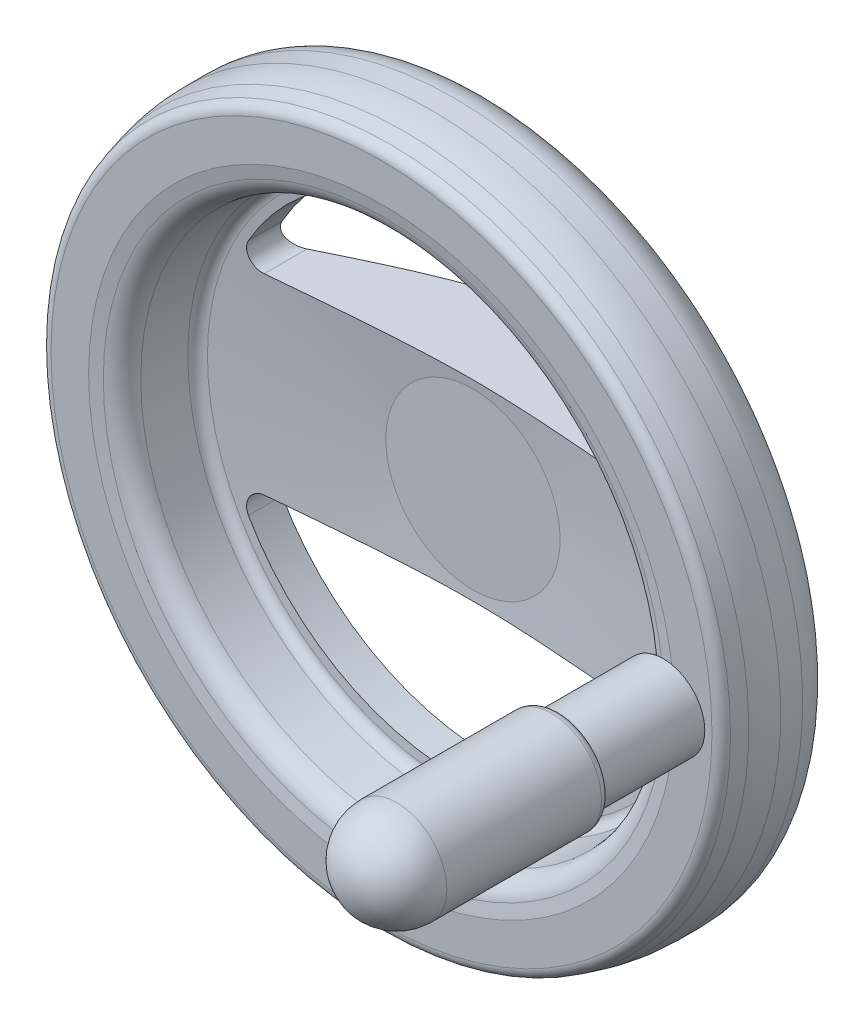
ISO-10303-21;
HEADER;
FILE_DESCRIPTION(('STEP AP214'),'2;1');
FILE_NAME('part.step','',(''),(''),'','','');
FILE_SCHEMA(('AUTOMOTIVE_DESIGN { 1 0 10303 214 1 1 1 1 }'));
ENDSEC;
DATA;
#1=APPLICATION_CONTEXT('core data for automotive mechanical design processes');
#2=APPLICATION_PROTOCOL_DEFINITION('international standard','automotive_design',2000,#1);
#3=PRODUCT_CONTEXT('',#1,'mechanical');
#4=PRODUCT('Part','Part','',(#3));
#5=PRODUCT_RELATED_PRODUCT_CATEGORY('part','',(#4));
#6=PRODUCT_DEFINITION_FORMATION('','',#4);
#7=PRODUCT_DEFINITION_CONTEXT('part definition',#1,'design');
#8=PRODUCT_DEFINITION('design','',#6,#7);
#9=PRODUCT_DEFINITION_SHAPE('','',#8);
#10=(LENGTH_UNIT() NAMED_UNIT(*) SI_UNIT(.MILLI.,.METRE.));
#11=(NAMED_UNIT(*) PLANE_ANGLE_UNIT() SI_UNIT($,.RADIAN.));
#12=(NAMED_UNIT(*) SI_UNIT($,.STERADIAN.) SOLID_ANGLE_UNIT());
#13=UNCERTAINTY_MEASURE_WITH_UNIT(LENGTH_MEASURE(1.E-05),#10,'distance_accuracy_value','');
#14=(GEOMETRIC_REPRESENTATION_CONTEXT(3) GLOBAL_UNCERTAINTY_ASSIGNED_CONTEXT((#13)) GLOBAL_UNIT_ASSIGNED_CONTEXT((#10,
#11,#12)) REPRESENTATION_CONTEXT('',''));
#15=CARTESIAN_POINT('',(0.,0.,0.));
#16=DIRECTION('',(0.,0.,1.));
#17=DIRECTION('',(1.,0.,0.));
#18=AXIS2_PLACEMENT_3D('',#15,#16,#17);
#19=CARTESIAN_POINT('',(-4.34375,0.,27.));
#20=DIRECTION('',(0.,0.,-1.));
#21=DIRECTION('',(0.,1.,0.));
#22=AXIS2_PLACEMENT_3D('',#19,#20,#21);
#23=PLANE('',#22);
#24=CARTESIAN_POINT('',(0.,0.,27.));
#25=DIRECTION('',(0.,0.,1.));
#26=DIRECTION('',(0.,-1.,0.));
#27=AXIS2_PLACEMENT_3D('',#24,#25,#26);
#28=CIRCLE('',#27,8.6875);
#29=CARTESIAN_POINT('',(0.,-8.6875,27.));
#30=VERTEX_POINT('',#29);
#31=EDGE_CURVE('E138',#30,#30,#28,.F.);
#32=ORIENTED_EDGE('',*,*,#31,.T.);
#33=EDGE_LOOP('',(#32));
#34=FACE_BOUND('',#33,.T.);
#35=ADVANCED_FACE('F14',(#34),#23,.T.);
#36=CARTESIAN_POINT('',(0.,0.,27.));
#37=DIRECTION('',(0.,0.,1.));
#38=DIRECTION('',(0.,-1.,0.));
#39=AXIS2_PLACEMENT_3D('',#36,#37,#38);
#40=CONICAL_SURFACE('',#39,8.6875,0.785398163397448);
#41=ORIENTED_EDGE('',*,*,#31,.F.);
#42=EDGE_LOOP('',(#41));
#43=FACE_BOUND('',#42,.T.);
#44=CARTESIAN_POINT('',(0.,0.,25.3125));
#45=DIRECTION('',(0.,0.,1.));
#46=DIRECTION('',(-1.,0.,0.));
#47=AXIS2_PLACEMENT_3D('',#44,#45,#46);
#48=CIRCLE('',#47,7.);
#49=CARTESIAN_POINT('',(-7.,0.,25.3125));
#50=VERTEX_POINT('',#49);
#51=EDGE_CURVE('E355',#50,#50,#48,.F.);
#52=ORIENTED_EDGE('',*,*,#51,.T.);
#53=EDGE_LOOP('',(#52));
#54=FACE_BOUND('',#53,.T.);
#55=ADVANCED_FACE('F237',(#43,#54),#40,.F.);
#56=CARTESIAN_POINT('',(0.,0.,12.75625));
#57=DIRECTION('',(0.,0.,1.));
#58=DIRECTION('',(-1.,0.,0.));
#59=AXIS2_PLACEMENT_3D('',#56,#57,#58);
#60=CYLINDRICAL_SURFACE('',#59,7.);
#61=ORIENTED_EDGE('',*,*,#51,.F.);
#62=EDGE_LOOP('',(#61));
#63=FACE_BOUND('',#62,.T.);
#64=CARTESIAN_POINT('',(0.,0.,0.2));
#65=DIRECTION('',(0.,0.,-1.));
#66=DIRECTION('',(-1.,0.,0.));
#67=AXIS2_PLACEMENT_3D('',#64,#65,#66);
#68=CIRCLE('',#67,7.);
#69=CARTESIAN_POINT('',(-7.,0.,0.2));
#70=VERTEX_POINT('',#69);
#71=EDGE_CURVE('E346',#70,#70,#68,.T.);
#72=ORIENTED_EDGE('',*,*,#71,.T.);
#73=EDGE_LOOP('',(#72));
#74=FACE_BOUND('',#73,.T.);
#75=ADVANCED_FACE('F233',(#63,#74),#60,.F.);
#76=CARTESIAN_POINT('',(0.,0.,0.));
#77=DIRECTION('',(0.,0.,-1.));
#78=DIRECTION('',(1.,0.,0.));
#79=AXIS2_PLACEMENT_3D('',#76,#77,#78);
#80=CONICAL_SURFACE('',#79,7.2,0.78539816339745);
#81=ORIENTED_EDGE('',*,*,#71,.F.);
#82=EDGE_LOOP('',(#81));
#83=FACE_BOUND('',#82,.T.);
#84=CARTESIAN_POINT('',(0.,0.,0.));
#85=DIRECTION('',(0.,0.,-1.));
#86=DIRECTION('',(1.,0.,0.));
#87=AXIS2_PLACEMENT_3D('',#84,#85,#86);
#88=CIRCLE('',#87,7.2);
#89=CARTESIAN_POINT('',(7.2,0.,0.));
#90=VERTEX_POINT('',#89);
#91=EDGE_CURVE('E354',#90,#90,#88,.F.);
#92=ORIENTED_EDGE('',*,*,#91,.F.);
#93=EDGE_LOOP('',(#92));
#94=FACE_BOUND('',#93,.T.);
#95=ADVANCED_FACE('F229',(#83,#94),#80,.F.);
#96=CARTESIAN_POINT('',(-10.1,0.,0.));
#97=DIRECTION('',(0.,0.,-1.));
#98=DIRECTION('',(0.,1.,0.));
#99=AXIS2_PLACEMENT_3D('',#96,#97,#98);
#100=PLANE('',#99);
#101=CARTESIAN_POINT('',(0.,0.,0.));
#102=DIRECTION('',(0.,0.,1.));
#103=DIRECTION('',(-1.,0.,0.));
#104=AXIS2_PLACEMENT_3D('',#101,#102,#103);
#105=CIRCLE('',#104,13.);
#106=CARTESIAN_POINT('',(-13.,0.,0.));
#107=VERTEX_POINT('',#106);
#108=EDGE_CURVE('E201',#107,#107,#105,.T.);
#109=ORIENTED_EDGE('',*,*,#108,.F.);
#110=EDGE_LOOP('',(#109));
#111=FACE_BOUND('',#110,.T.);
#112=ORIENTED_EDGE('',*,*,#91,.T.);
#113=EDGE_LOOP('',(#112));
#114=FACE_BOUND('',#113,.T.);
#115=ADVANCED_FACE('F225',(#111,#114),#100,.T.);
#116=CARTESIAN_POINT('',(0.,0.,0.1));
#117=DIRECTION('',(0.,0.,1.));
#118=DIRECTION('',(-1.,0.,0.));
#119=AXIS2_PLACEMENT_3D('',#116,#117,#118);
#120=CYLINDRICAL_SURFACE('',#119,13.);
#121=ORIENTED_EDGE('',*,*,#108,.T.);
#122=EDGE_LOOP('',(#121));
#123=FACE_BOUND('',#122,.T.);
#124=CARTESIAN_POINT('',(0.,0.,0.2));
#125=DIRECTION('',(0.,0.,1.));
#126=DIRECTION('',(-1.,0.,0.));
#127=AXIS2_PLACEMENT_3D('',#124,#125,#126);
#128=CIRCLE('',#127,13.);
#129=CARTESIAN_POINT('',(-13.,0.,0.2));
#130=VERTEX_POINT('',#129);
#131=EDGE_CURVE('E821',#130,#130,#128,.T.);
#132=ORIENTED_EDGE('',*,*,#131,.F.);
#133=EDGE_LOOP('',(#132));
#134=FACE_BOUND('',#133,.T.);
#135=ADVANCED_FACE('F228',(#123,#134),#120,.T.);
#136=CARTESIAN_POINT('',(-16.25,0.,0.2));
#137=DIRECTION('',(0.,0.,-1.));
#138=DIRECTION('',(0.,1.,0.));
#139=AXIS2_PLACEMENT_3D('',#136,#137,#138);
#140=PLANE('',#139);
#141=CARTESIAN_POINT('',(0.,0.,0.2));
#142=DIRECTION('',(0.,0.,1.));
#143=DIRECTION('',(0.,-1.,0.));
#144=AXIS2_PLACEMENT_3D('',#141,#142,#143);
#145=CIRCLE('',#144,19.5);
#146=CARTESIAN_POINT('',(0.,-19.5,0.2));
#147=VERTEX_POINT('',#146);
#148=CARTESIAN_POINT('',(0.,19.5,0.2));
#149=VERTEX_POINT('',#148);
#150=EDGE_CURVE('E775',#147,#149,#145,.T.);
#151=ORIENTED_EDGE('',*,*,#150,.F.);
#152=CARTESIAN_POINT('',(0.,0.,0.2));
#153=DIRECTION('',(0.,0.,1.));
#154=DIRECTION('',(-1.,0.,0.));
#155=AXIS2_PLACEMENT_3D('',#152,#153,#154);
#156=CIRCLE('',#155,19.5);
#157=CARTESIAN_POINT('',(-19.5,0.,0.2));
#158=VERTEX_POINT('',#157);
#159=EDGE_CURVE('E688',#158,#147,#156,.T.);
#160=ORIENTED_EDGE('',*,*,#159,.F.);
#161=CARTESIAN_POINT('',(0.,0.,0.2));
#162=DIRECTION('',(0.,0.,1.));
#163=DIRECTION('',(0.,1.,0.));
#164=AXIS2_PLACEMENT_3D('',#161,#162,#163);
#165=CIRCLE('',#164,19.5);
#166=EDGE_CURVE('E747',#149,#158,#165,.T.);
#167=ORIENTED_EDGE('',*,*,#166,.F.);
#168=EDGE_LOOP('',(#151,#160,#167));
#169=FACE_BOUND('',#168,.T.);
#170=ORIENTED_EDGE('',*,*,#131,.T.);
#171=EDGE_LOOP('',(#170));
#172=FACE_BOUND('',#171,.T.);
#173=ADVANCED_FACE('F660',(#169,#172),#140,.T.);
#174=CARTESIAN_POINT('',(0.,0.,0.7));
#175=DIRECTION('',(0.,0.,-1.));
#176=DIRECTION('',(0.,1.,0.));
#177=AXIS2_PLACEMENT_3D('',#174,#175,#176);
#178=TOROIDAL_SURFACE('',#177,19.5,0.5);
#179=CARTESIAN_POINT('',(0.,0.,0.7));
#180=DIRECTION('',(0.,0.,1.));
#181=DIRECTION('',(-1.,0.,0.));
#182=AXIS2_PLACEMENT_3D('',#179,#180,#181);
#183=CIRCLE('',#182,20.);
#184=CARTESIAN_POINT('',(-20.,0.,0.7));
#185=VERTEX_POINT('',#184);
#186=EDGE_CURVE('E649',#185,#185,#183,.T.);
#187=ORIENTED_EDGE('',*,*,#186,.F.);
#188=EDGE_LOOP('',(#187));
#189=FACE_BOUND('',#188,.T.);
#190=ORIENTED_EDGE('',*,*,#150,.T.);
#191=ORIENTED_EDGE('',*,*,#166,.T.);
#192=ORIENTED_EDGE('',*,*,#159,.T.);
#193=EDGE_LOOP('',(#190,#191,#192));
#194=FACE_BOUND('',#193,.T.);
#195=ADVANCED_FACE('F656',(#189,#194),#178,.T.);
#196=CARTESIAN_POINT('',(0.,0.,3.725));
#197=DIRECTION('',(0.,0.,1.));
#198=DIRECTION('',(-1.,0.,0.));
#199=AXIS2_PLACEMENT_3D('',#196,#197,#198);
#200=CYLINDRICAL_SURFACE('',#199,20.);
#201=ORIENTED_EDGE('',*,*,#186,.T.);
#202=EDGE_LOOP('',(#201));
#203=FACE_BOUND('',#202,.T.);
#204=CARTESIAN_POINT('',(0.,0.,6.75));
#205=DIRECTION('',(0.,0.,1.));
#206=DIRECTION('',(-1.,0.,0.));
#207=AXIS2_PLACEMENT_3D('',#204,#205,#206);
#208=CIRCLE('',#207,20.);
#209=CARTESIAN_POINT('',(-20.,0.,6.75));
#210=VERTEX_POINT('',#209);
#211=EDGE_CURVE('E1446',#210,#210,#208,.T.);
#212=ORIENTED_EDGE('',*,*,#211,.F.);
#213=EDGE_LOOP('',(#212));
#214=FACE_BOUND('',#213,.T.);
#215=ADVANCED_FACE('F620',(#203,#214),#200,.T.);
#216=CARTESIAN_POINT('',(0.,0.,36.8543437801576));
#217=DIRECTION('',(0.,0.,1.));
#218=DIRECTION('',(-1.,0.,0.));
#219=AXIS2_PLACEMENT_3D('',#216,#217,#218);
#220=CYLINDRICAL_SURFACE('',#219,80.);
#221=CARTESIAN_POINT('',(0.,0.,39.3753542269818));
#222=DIRECTION('',(0.,0.,1.));
#223=DIRECTION('',(-1.,0.,0.));
#224=AXIS2_PLACEMENT_3D('',#221,#222,#223);
#225=CIRCLE('',#224,80.);
#226=CARTESIAN_POINT('',(-80.,0.,39.3753542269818));
#227=VERTEX_POINT('',#226);
#228=EDGE_CURVE('E480',#227,#227,#225,.F.);
#229=ORIENTED_EDGE('',*,*,#228,.T.);
#230=EDGE_LOOP('',(#229));
#231=FACE_BOUND('',#230,.T.);
#232=CARTESIAN_POINT('',(0.,0.,34.3333333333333));
#233=DIRECTION('',(0.,0.,-1.));
#234=DIRECTION('',(0.,1.,0.));
#235=AXIS2_PLACEMENT_3D('',#232,#233,#234);
#236=CIRCLE('',#235,80.);
#237=CARTESIAN_POINT('',(0.,80.,34.3333333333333));
#238=VERTEX_POINT('',#237);
#239=EDGE_CURVE('E362',#238,#238,#236,.T.);
#240=ORIENTED_EDGE('',*,*,#239,.F.);
#241=EDGE_LOOP('',(#240));
#242=FACE_BOUND('',#241,.T.);
#243=ADVANCED_FACE('F392',(#231,#242),#220,.T.);
#244=CARTESIAN_POINT('',(0.,0.,21.));
#245=DIRECTION('',(0.,0.,-1.));
#246=DIRECTION('',(0.,1.,0.));
#247=AXIS2_PLACEMENT_3D('',#244,#245,#246);
#248=TOROIDAL_SURFACE('',#247,56.2438135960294,5.);
#249=CARTESIAN_POINT('',(0.,0.,25.8838614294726));
#250=DIRECTION('',(0.,0.,-1.));
#251=DIRECTION('',(0.,1.,0.));
#252=AXIS2_PLACEMENT_3D('',#249,#250,#251);
#253=CIRCLE('',#252,55.1724137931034);
#254=CARTESIAN_POINT('',(-47.9357497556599,27.315913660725,25.8838614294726));
#255=VERTEX_POINT('',#254);
#256=CARTESIAN_POINT('',(47.9357492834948,27.3159144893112,25.8838614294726));
#257=VERTEX_POINT('',#256);
#258=EDGE_CURVE('E418',#255,#257,#253,.T.);
#259=ORIENTED_EDGE('',*,*,#258,.F.);
#260=CARTESIAN_POINT('',(-48.1117799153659,24.1483271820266,25.3798622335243));
#261=CARTESIAN_POINT('',(-48.1453075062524,24.226058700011,25.4155722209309));
#262=CARTESIAN_POINT('',(-48.1764266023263,24.305965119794,25.4487865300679));
#263=CARTESIAN_POINT('',(-48.2332496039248,24.4694059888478,25.5105013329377));
#264=CARTESIAN_POINT('',(-48.2589553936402,24.5529391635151,25.5390034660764));
#265=CARTESIAN_POINT('',(-48.3042755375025,24.7225842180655,25.5914775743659));
#266=CARTESIAN_POINT('',(-48.3239167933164,24.808682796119,25.6154693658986));
#267=CARTESIAN_POINT('',(-48.3568455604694,24.9830878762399,25.6594549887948));
#268=CARTESIAN_POINT('',(-48.370132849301,25.0713944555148,25.6794486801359));
#269=CARTESIAN_POINT('',(-48.390042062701,25.2494390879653,25.715831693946));
#270=CARTESIAN_POINT('',(-48.396667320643,25.3391764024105,25.7322228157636));
#271=CARTESIAN_POINT('',(-48.4030733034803,25.5194539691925,25.7618353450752));
#272=CARTESIAN_POINT('',(-48.4028509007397,25.6099945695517,25.7750553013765));
#273=CARTESIAN_POINT('',(-48.3954524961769,25.7912408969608,25.7987294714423));
#274=CARTESIAN_POINT('',(-48.3882697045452,25.8819466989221,25.8091809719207));
#275=CARTESIAN_POINT('',(-48.3669240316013,26.0627820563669,25.8276721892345));
#276=CARTESIAN_POINT('',(-48.352760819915,26.1529115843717,25.8357117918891));
#277=CARTESIAN_POINT('',(-48.3166540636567,26.3362902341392,25.8500403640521));
#278=CARTESIAN_POINT('',(-48.2943681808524,26.4294801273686,25.8562261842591));
#279=CARTESIAN_POINT('',(-48.242309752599,26.6138632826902,25.8666057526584));
#280=CARTESIAN_POINT('',(-48.2125366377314,26.7050563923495,25.8707993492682));
#281=CARTESIAN_POINT('',(-48.1456825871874,26.8848168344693,25.8774230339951));
#282=CARTESIAN_POINT('',(-48.108599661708,26.9733834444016,25.8798526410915));
#283=CARTESIAN_POINT('',(-48.0273918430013,27.1472490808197,25.8830636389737));
#284=CARTESIAN_POINT('',(-47.9832675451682,27.2325483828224,25.8838451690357));
#285=CARTESIAN_POINT('',(-47.9357497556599,27.315913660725,25.8838614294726));
#286=B_SPLINE_CURVE_WITH_KNOTS('',3,(#260,#261,#262,#263,#264,#265,#266,#267,#268,#269,#270,
#271,#272,#273,#274,#275,#276,#277,#278,#279,#280,#281,#282,#283,#284,#285),.UNSPECIFIED.,.F.,
.F.,(4,2,2,2,2,2,2,2,2,2,2,2,4),(0.,0.275531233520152,0.550966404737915,0.825161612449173,
1.09936642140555,1.37343396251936,1.64762668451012,1.92208714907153,2.19656060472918,
2.48427355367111,2.77200839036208,3.05982165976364,3.34761060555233),.UNSPECIFIED.);
#287=CARTESIAN_POINT('',(-48.1117799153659,24.1483271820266,25.3798622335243));
#288=VERTEX_POINT('',#287);
#289=EDGE_CURVE('E421',#288,#255,#286,.T.);
#290=ORIENTED_EDGE('',*,*,#289,.F.);
#291=CARTESIAN_POINT('',(0.,0.,25.3798622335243));
#292=DIRECTION('',(0.,0.,-1.));
#293=DIRECTION('',(0.,1.,0.));
#294=AXIS2_PLACEMENT_3D('',#291,#292,#293);
#295=CIRCLE('',#294,53.8320078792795);
#296=CARTESIAN_POINT('',(-48.1117799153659,-24.1483271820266,25.3798622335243));
#297=VERTEX_POINT('',#296);
#298=EDGE_CURVE('E441',#297,#288,#295,.T.);
#299=ORIENTED_EDGE('',*,*,#298,.F.);
#300=CARTESIAN_POINT('',(-47.9357492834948,-27.3159144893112,25.8838614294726));
#301=CARTESIAN_POINT('',(-47.9836189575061,-27.231932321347,25.8838446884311));
#302=CARTESIAN_POINT('',(-48.0280444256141,-27.1459874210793,25.8830517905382));
#303=CARTESIAN_POINT('',(-48.109746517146,-26.9707898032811,25.8797928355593));
#304=CARTESIAN_POINT('',(-48.1470227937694,-26.8815369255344,25.8773266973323));
#305=CARTESIAN_POINT('',(-48.2141706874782,-26.7003241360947,25.8705994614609));
#306=CARTESIAN_POINT('',(-48.2440402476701,-26.6083634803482,25.8663378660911));
#307=CARTESIAN_POINT('',(-48.2961696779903,-26.4224263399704,25.8557844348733));
#308=CARTESIAN_POINT('',(-48.3184298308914,-26.3284499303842,25.849492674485));
#309=CARTESIAN_POINT('',(-48.3552449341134,-26.1390019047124,25.834553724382));
#310=CARTESIAN_POINT('',(-48.3697856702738,-26.043527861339,25.8259022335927));
#311=CARTESIAN_POINT('',(-48.3910423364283,-25.8519985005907,25.80586135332));
#312=CARTESIAN_POINT('',(-48.3977585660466,-25.7559432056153,25.7944720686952));
#313=CARTESIAN_POINT('',(-48.4033942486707,-25.564148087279,25.7685260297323));
#314=CARTESIAN_POINT('',(-48.4023231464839,-25.4684080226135,25.7539731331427));
#315=CARTESIAN_POINT('',(-48.3925425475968,-25.2779958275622,25.7212186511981));
#316=CARTESIAN_POINT('',(-48.3838373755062,-25.1833231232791,25.7030191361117));
#317=CARTESIAN_POINT('',(-48.3605016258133,-25.0067908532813,25.6648431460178));
#318=CARTESIAN_POINT('',(-48.3466806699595,-24.9247248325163,25.645321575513));
#319=CARTESIAN_POINT('',(-48.3135612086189,-24.7626525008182,25.6027230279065));
#320=CARTESIAN_POINT('',(-48.2942633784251,-24.6826459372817,25.5796464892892));
#321=CARTESIAN_POINT('',(-48.2504715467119,-24.5249999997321,25.5295518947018));
#322=CARTESIAN_POINT('',(-48.2259594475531,-24.4473699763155,25.5025202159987));
#323=CARTESIAN_POINT('',(-48.1722568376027,-24.2953043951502,25.4443374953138));
#324=CARTESIAN_POINT('',(-48.1430646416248,-24.2208700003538,25.4131849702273));
#325=CARTESIAN_POINT('',(-48.1117799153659,-24.1483271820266,25.3798622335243));
#326=B_SPLINE_CURVE_WITH_KNOTS('',3,(#300,#301,#302,#303,#304,#305,#306,#307,#308,#309,#310,
#311,#312,#313,#314,#315,#316,#317,#318,#319,#320,#321,#322,#323,#324,#325),.UNSPECIFIED.,.F.,
.F.,(4,2,2,2,2,2,2,2,2,2,2,2,4),(0.,0.289917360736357,0.579848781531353,0.86986062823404,
1.15986169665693,1.45039492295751,1.74091702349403,2.03108682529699,2.3210923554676,
2.57726983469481,2.83341574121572,3.09046562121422,3.34760826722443),.UNSPECIFIED.);
#327=CARTESIAN_POINT('',(-47.9357492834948,-27.3159144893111,25.8838614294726));
#328=VERTEX_POINT('',#327);
#329=EDGE_CURVE('E444',#328,#297,#326,.T.);
#330=ORIENTED_EDGE('',*,*,#329,.F.);
#331=CARTESIAN_POINT('',(0.,0.,25.8838614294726));
#332=DIRECTION('',(0.,0.,-1.));
#333=DIRECTION('',(0.,1.,0.));
#334=AXIS2_PLACEMENT_3D('',#331,#332,#333);
#335=CIRCLE('',#334,55.1724137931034);
#336=CARTESIAN_POINT('',(47.9357492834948,-27.3159144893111,25.8838614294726));
#337=VERTEX_POINT('',#336);
#338=EDGE_CURVE('E372',#337,#328,#335,.T.);
#339=ORIENTED_EDGE('',*,*,#338,.F.);
#340=CARTESIAN_POINT('',(48.1117799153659,-24.1483271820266,25.3798622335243));
#341=CARTESIAN_POINT('',(48.1453075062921,-24.2260587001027,25.4155722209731));
#342=CARTESIAN_POINT('',(48.1764266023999,-24.3059651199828,25.4487865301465));
#343=CARTESIAN_POINT('',(48.2332496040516,-24.4694059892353,25.5105013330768));
#344=CARTESIAN_POINT('',(48.2589553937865,-24.5529391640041,25.53900346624));
#345=CARTESIAN_POINT('',(48.3042755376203,-24.7225842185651,25.5914775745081));
#346=CARTESIAN_POINT('',(48.3239167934,-24.8086827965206,25.6154693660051));
#347=CARTESIAN_POINT('',(48.3568455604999,-24.9830878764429,25.6594549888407));
#348=CARTESIAN_POINT('',(48.3701328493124,-25.071394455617,25.6794486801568));
#349=CARTESIAN_POINT('',(48.3900420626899,-25.2494390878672,25.715831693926));
#350=CARTESIAN_POINT('',(48.3966673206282,-25.3391764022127,25.7322228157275));
#351=CARTESIAN_POINT('',(48.4030733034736,-25.5194539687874,25.7618353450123));
#352=CARTESIAN_POINT('',(48.4028509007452,-25.6099945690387,25.7750553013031));
#353=CARTESIAN_POINT('',(48.3954524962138,-25.7912408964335,25.7987294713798));
#354=CARTESIAN_POINT('',(48.3882697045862,-25.8819466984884,25.8091809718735));
#355=CARTESIAN_POINT('',(48.3669240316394,-26.0627820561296,25.827672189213));
#356=CARTESIAN_POINT('',(48.3527608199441,-26.1529115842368,25.8357117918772));
#357=CARTESIAN_POINT('',(48.316654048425,-26.3362903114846,25.850040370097));
#358=CARTESIAN_POINT('',(48.2943681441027,-26.4294802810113,25.8562261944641));
#359=CARTESIAN_POINT('',(48.2423096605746,-26.613863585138,25.8666057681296));
#360=CARTESIAN_POINT('',(48.2125365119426,-26.705056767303,25.8707993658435));
#361=CARTESIAN_POINT('',(48.1456823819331,-26.8848173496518,25.8774230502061));
#362=CARTESIAN_POINT('',(48.1085994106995,-26.973384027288,25.8798526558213));
#363=CARTESIAN_POINT('',(48.0273914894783,-27.1472497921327,25.8830636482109));
#364=CARTESIAN_POINT('',(47.983267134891,-27.2325491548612,25.883845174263));
#365=CARTESIAN_POINT('',(47.9357492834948,-27.3159144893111,25.8838614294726));
#366=B_SPLINE_CURVE_WITH_KNOTS('',3,(#340,#341,#342,#343,#344,#345,#346,#347,#348,#349,#350,
#351,#352,#353,#354,#355,#356,#357,#358,#359,#360,#361,#362,#363,#364,#365),.UNSPECIFIED.,.F.,
.F.,(4,2,2,2,2,2,2,2,2,2,2,2,4),(0.,0.275531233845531,0.550966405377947,0.825161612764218,
1.09936642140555,1.37343396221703,1.6476266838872,1.9220871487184,2.19656060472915,
2.48427379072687,2.77200886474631,3.05982237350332,3.34761155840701),.UNSPECIFIED.);
#367=CARTESIAN_POINT('',(48.1117799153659,-24.1483271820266,25.3798622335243));
#368=VERTEX_POINT('',#367);
#369=EDGE_CURVE('E363',#368,#337,#366,.T.);
#370=ORIENTED_EDGE('',*,*,#369,.F.);
#371=CARTESIAN_POINT('',(0.,0.,25.3798622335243));
#372=DIRECTION('',(0.,0.,-1.));
#373=DIRECTION('',(0.,1.,0.));
#374=AXIS2_PLACEMENT_3D('',#371,#372,#373);
#375=CIRCLE('',#374,53.8320078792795);
#376=CARTESIAN_POINT('',(48.1117799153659,24.1483271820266,25.3798622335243));
#377=VERTEX_POINT('',#376);
#378=EDGE_CURVE('E373',#377,#368,#375,.T.);
#379=ORIENTED_EDGE('',*,*,#378,.F.);
#380=CARTESIAN_POINT('',(47.9357492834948,27.3159144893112,25.8838614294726));
#381=CARTESIAN_POINT('',(47.9836189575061,27.231932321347,25.8838446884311));
#382=CARTESIAN_POINT('',(48.0280444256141,27.1459874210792,25.8830517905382));
#383=CARTESIAN_POINT('',(48.109746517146,26.9707898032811,25.8797928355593));
#384=CARTESIAN_POINT('',(48.1470227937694,26.8815369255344,25.8773266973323));
#385=CARTESIAN_POINT('',(48.2141706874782,26.7003241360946,25.8705994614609));
#386=CARTESIAN_POINT('',(48.2440402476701,26.6083634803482,25.8663378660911));
#387=CARTESIAN_POINT('',(48.2961696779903,26.4224263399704,25.8557844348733));
#388=CARTESIAN_POINT('',(48.3184298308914,26.3284499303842,25.849492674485));
#389=CARTESIAN_POINT('',(48.3552449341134,26.1390019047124,25.834553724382));
#390=CARTESIAN_POINT('',(48.3697856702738,26.043527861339,25.8259022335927));
#391=CARTESIAN_POINT('',(48.3910423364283,25.8519985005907,25.80586135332));
#392=CARTESIAN_POINT('',(48.3977585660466,25.7559432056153,25.7944720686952));
#393=CARTESIAN_POINT('',(48.4033942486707,25.564148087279,25.7685260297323));
#394=CARTESIAN_POINT('',(48.4023231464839,25.4684080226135,25.7539731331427));
#395=CARTESIAN_POINT('',(48.3925425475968,25.2779958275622,25.7212186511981));
#396=CARTESIAN_POINT('',(48.3838373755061,25.1833231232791,25.7030191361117));
#397=CARTESIAN_POINT('',(48.3605016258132,25.0067908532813,25.6648431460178));
#398=CARTESIAN_POINT('',(48.3466806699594,24.9247248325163,25.6453215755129));
#399=CARTESIAN_POINT('',(48.3135612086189,24.7626525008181,25.6027230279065));
#400=CARTESIAN_POINT('',(48.2942633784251,24.6826459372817,25.5796464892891));
#401=CARTESIAN_POINT('',(48.2504715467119,24.5249999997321,25.5295518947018));
#402=CARTESIAN_POINT('',(48.225959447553,24.4473699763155,25.5025202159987));
#403=CARTESIAN_POINT('',(48.1722568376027,24.2953043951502,25.4443374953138));
#404=CARTESIAN_POINT('',(48.1430646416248,24.2208700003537,25.4131849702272));
#405=CARTESIAN_POINT('',(48.1117799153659,24.1483271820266,25.3798622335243));
#406=B_SPLINE_CURVE_WITH_KNOTS('',3,(#380,#381,#382,#383,#384,#385,#386,#387,#388,#389,#390,
#391,#392,#393,#394,#395,#396,#397,#398,#399,#400,#401,#402,#403,#404,#405),.UNSPECIFIED.,.F.,
.F.,(4,2,2,2,2,2,2,2,2,2,2,2,4),(0.,0.289917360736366,0.579848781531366,0.869860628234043,
1.15986169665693,1.4503949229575,1.74091702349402,2.03108682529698,2.32109235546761,
2.57726983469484,2.83341574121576,3.09046562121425,3.34760826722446),.UNSPECIFIED.);
#407=EDGE_CURVE('E374',#257,#377,#406,.T.);
#408=ORIENTED_EDGE('',*,*,#407,.F.);
#409=EDGE_LOOP('',(#259,#290,#299,#330,#339,#370,#379,#408));
#410=FACE_BOUND('',#409,.T.);
#411=CARTESIAN_POINT('',(0.,0.,26.));
#412=DIRECTION('',(0.,0.,-1.));
#413=DIRECTION('',(-1.,0.,0.));
#414=AXIS2_PLACEMENT_3D('',#411,#412,#413);
#415=CIRCLE('',#414,56.2438135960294);
#416=CARTESIAN_POINT('',(0.,56.2438135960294,26.));
#417=VERTEX_POINT('',#416);
#418=CARTESIAN_POINT('',(-56.2438135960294,0.,26.));
#419=VERTEX_POINT('',#418);
#420=EDGE_CURVE('E361',#417,#419,#415,.F.);
#421=ORIENTED_EDGE('',*,*,#420,.F.);
#422=CARTESIAN_POINT('',(0.,0.,26.));
#423=DIRECTION('',(0.,0.,-1.));
#424=DIRECTION('',(0.,1.,0.));
#425=AXIS2_PLACEMENT_3D('',#422,#423,#424);
#426=CIRCLE('',#425,56.2438135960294);
#427=CARTESIAN_POINT('',(0.,-56.2438135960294,26.));
#428=VERTEX_POINT('',#427);
#429=EDGE_CURVE('E430',#428,#417,#426,.F.);
#430=ORIENTED_EDGE('',*,*,#429,.F.);
#431=CARTESIAN_POINT('',(0.,0.,26.));
#432=DIRECTION('',(0.,0.,-1.));
#433=DIRECTION('',(0.,-1.,0.));
#434=AXIS2_PLACEMENT_3D('',#431,#432,#433);
#435=CIRCLE('',#434,56.2438135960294);
#436=EDGE_CURVE('E1023',#419,#428,#435,.F.);
#437=ORIENTED_EDGE('',*,*,#436,.F.);
#438=EDGE_LOOP('',(#421,#430,#437));
#439=FACE_BOUND('',#438,.T.);
#440=ADVANCED_FACE('F385',(#410,#439),#248,.F.);
#441=CARTESIAN_POINT('',(0.,0.,25.3798622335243));
#442=DIRECTION('',(0.,0.,1.));
#443=DIRECTION('',(-1.,0.,0.));
#444=AXIS2_PLACEMENT_3D('',#441,#442,#443);
#445=CONICAL_SURFACE('',#444,53.8320078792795,1.06744815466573);
#446=ORIENTED_EDGE('',*,*,#211,.T.);
#447=EDGE_LOOP('',(#446));
#448=FACE_BOUND('',#447,.T.);
#449=CARTESIAN_POINT('',(-44.8465565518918,-22.,23.2433677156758));
#450=CARTESIAN_POINT('',(-45.0748243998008,-21.9999944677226,23.3562492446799));
#451=CARTESIAN_POINT('',(-45.3006653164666,-22.021963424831,23.4733627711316));
#452=CARTESIAN_POINT('',(-45.7417829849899,-22.1072284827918,23.7124055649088));
#453=CARTESIAN_POINT('',(-45.9570603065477,-22.1705223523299,23.8343345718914));
#454=CARTESIAN_POINT('',(-46.3711994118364,-22.3357493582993,24.0792743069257));
#455=CARTESIAN_POINT('',(-46.5700742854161,-22.4376513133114,24.202284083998));
#456=CARTESIAN_POINT('',(-46.9461855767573,-22.6775069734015,24.4462079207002));
#457=CARTESIAN_POINT('',(-47.1234378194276,-22.8154340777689,24.5671234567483));
#458=CARTESIAN_POINT('',(-47.3730065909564,-23.0509474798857,24.7474043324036));
#459=CARTESIAN_POINT('',(-47.4552654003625,-23.1367052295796,24.8088004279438));
#460=CARTESIAN_POINT('',(-47.6114038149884,-23.3168533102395,24.9296016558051));
#461=CARTESIAN_POINT('',(-47.6852845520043,-23.4112424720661,24.9890070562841));
#462=CARTESIAN_POINT('',(-47.8240221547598,-23.6084393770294,25.1055093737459));
#463=CARTESIAN_POINT('',(-47.8888434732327,-23.7112779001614,25.1625966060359));
#464=CARTESIAN_POINT('',(-48.0082452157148,-23.9244068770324,25.2736931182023));
#465=CARTESIAN_POINT('',(-48.0628183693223,-24.0347025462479,25.3277001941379));
#466=CARTESIAN_POINT('',(-48.1117799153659,-24.1483271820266,25.3798622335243));
#467=B_SPLINE_CURVE_WITH_KNOTS('',3,(#449,#450,#451,#452,#453,#454,#455,#456,#457,#458,#459,
#460,#461,#462,#463,#464,#465,#466),.UNSPECIFIED.,.F.,.F.,(4,2,2,2,2,2,2,2,4),(0.,
0.762575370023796,1.52510956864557,2.28702922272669,3.04838786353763,3.44918961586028,
3.84993715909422,4.25221547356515,4.65477810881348),.UNSPECIFIED.);
#468=CARTESIAN_POINT('',(-44.8465565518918,-22.,23.2433677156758));
#469=VERTEX_POINT('',#468);
#470=EDGE_CURVE('E571',#469,#297,#467,.T.);
#471=ORIENTED_EDGE('',*,*,#470,.T.);
#472=ORIENTED_EDGE('',*,*,#298,.T.);
#473=CARTESIAN_POINT('',(-48.1117799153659,24.1483271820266,25.3798622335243));
#474=CARTESIAN_POINT('',(-48.0676828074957,24.0460190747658,25.3328888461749));
#475=CARTESIAN_POINT('',(-48.0190665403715,23.9464352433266,25.2844416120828));
#476=CARTESIAN_POINT('',(-47.9134424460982,23.7532479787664,25.1849985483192));
#477=CARTESIAN_POINT('',(-47.8564394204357,23.6596411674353,25.1340041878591));
#478=CARTESIAN_POINT('',(-47.674274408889,23.3892123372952,24.978176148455));
#479=CARTESIAN_POINT('',(-47.5375553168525,23.221869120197,24.8700754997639));
#480=CARTESIAN_POINT('',(-47.238989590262,22.9166549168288,24.6486892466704));
#481=CARTESIAN_POINT('',(-47.0771958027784,22.7787233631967,24.5354148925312));
#482=CARTESIAN_POINT('',(-46.7327228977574,22.5341282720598,24.3060280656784));
#483=CARTESIAN_POINT('',(-46.5500077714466,22.4275198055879,24.1899109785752));
#484=CARTESIAN_POINT('',(-46.1552260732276,22.2419104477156,23.9497037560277));
#485=CARTESIAN_POINT('',(-45.9420006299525,22.1653596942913,23.8256235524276));
#486=CARTESIAN_POINT('',(-45.5033007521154,22.0538911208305,23.5814200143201));
#487=CARTESIAN_POINT('',(-45.2778610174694,22.0188612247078,23.4612868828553));
#488=CARTESIAN_POINT('',(-44.9820626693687,22.001938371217,23.310844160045));
#489=CARTESIAN_POINT('',(-44.9143937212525,21.9999952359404,23.2769047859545));
#490=CARTESIAN_POINT('',(-44.8465565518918,22.,23.2433677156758));
#491=B_SPLINE_CURVE_WITH_KNOTS('',3,(#473,#474,#475,#476,#477,#478,#479,#480,#481,#482,#483,
#484,#485,#486,#487,#488,#489,#490),.UNSPECIFIED.,.F.,.F.,(4,2,2,2,2,2,2,2,4),(0.,
0.362439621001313,0.724672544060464,1.44593352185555,2.16569454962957,2.88671356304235,
3.65812295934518,4.42744533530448,4.65452461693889),.UNSPECIFIED.);
#492=CARTESIAN_POINT('',(-44.8465565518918,22.,23.2433677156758));
#493=VERTEX_POINT('',#492);
#494=EDGE_CURVE('E604',#288,#493,#491,.T.);
#495=ORIENTED_EDGE('',*,*,#494,.T.);
#496=CARTESIAN_POINT('',(-44.8465565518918,22.,23.2433677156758));
#497=CARTESIAN_POINT('',(-44.302580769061,22.,22.9744421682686));
#498=CARTESIAN_POINT('',(-43.7582304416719,22.,22.7062743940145));
#499=CARTESIAN_POINT('',(-42.6687043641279,22.,22.1716167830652));
#500=CARTESIAN_POINT('',(-42.12352861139,22.,21.9051269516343));
#501=CARTESIAN_POINT('',(-40.4866004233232,22.,21.1083944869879));
#502=CARTESIAN_POINT('',(-39.3935002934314,22.,20.5809152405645));
#503=CARTESIAN_POINT('',(-37.2010187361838,22.,19.5340373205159));
#504=CARTESIAN_POINT('',(-36.1016295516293,22.,19.0146548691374));
#505=CARTESIAN_POINT('',(-33.8976257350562,22.,17.9871354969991));
#506=CARTESIAN_POINT('',(-32.79301119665,22.,17.4789983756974));
#507=CARTESIAN_POINT('',(-30.5168256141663,22.,16.4494243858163));
#508=CARTESIAN_POINT('',(-29.3448950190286,22.,15.9287787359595));
#509=CARTESIAN_POINT('',(-27.580358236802,22.,15.1630172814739));
#510=CARTESIAN_POINT('',(-26.9910528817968,22.,14.9102898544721));
#511=CARTESIAN_POINT('',(-25.8099813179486,22.,14.4106575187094));
#512=CARTESIAN_POINT('',(-25.2182151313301,22.,14.1637525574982));
#513=CARTESIAN_POINT('',(-24.0322704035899,22.,13.6767494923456));
#514=CARTESIAN_POINT('',(-23.4380933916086,22.,13.4366476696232));
#515=CARTESIAN_POINT('',(-22.2467009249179,22.,12.9641188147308));
#516=CARTESIAN_POINT('',(-21.6494855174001,22.,12.731691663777));
#517=CARTESIAN_POINT('',(-20.4517254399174,22.,12.2757108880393));
#518=CARTESIAN_POINT('',(-19.8511810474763,22.,12.0521565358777));
#519=CARTESIAN_POINT('',(-18.6463842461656,22.,11.6153002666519));
#520=CARTESIAN_POINT('',(-18.0421319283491,22.,11.4019980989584));
#521=CARTESIAN_POINT('',(-16.7421458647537,22.,10.9573666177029));
#522=CARTESIAN_POINT('',(-16.0457817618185,22.,10.7278713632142));
#523=CARTESIAN_POINT('',(-14.6472357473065,22.,10.2872685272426));
#524=CARTESIAN_POINT('',(-13.9450538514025,22.,10.0761608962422));
#525=CARTESIAN_POINT('',(-12.5344350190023,22.,9.67563362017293));
#526=CARTESIAN_POINT('',(-11.8259975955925,22.,9.486215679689));
#527=CARTESIAN_POINT('',(-10.4027608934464,22.,9.1328234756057));
#528=CARTESIAN_POINT('',(-9.68796164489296,22.,8.96884909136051));
#529=CARTESIAN_POINT('',(-8.26627958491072,22.,8.67328138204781));
#530=CARTESIAN_POINT('',(-7.55951673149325,22.,8.54111570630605));
#531=CARTESIAN_POINT('',(-6.14070283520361,22.,8.30885368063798));
#532=CARTESIAN_POINT('',(-5.42865189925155,22.,8.20875668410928));
#533=CARTESIAN_POINT('',(-4.00081515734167,22.,8.04401178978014));
#534=CARTESIAN_POINT('',(-3.28503164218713,22.,7.97934425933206));
#535=CARTESIAN_POINT('',(-1.8510334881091,22.,7.88779582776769));
#536=CARTESIAN_POINT('',(-1.13281888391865,22.,7.86091438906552));
#537=CARTESIAN_POINT('',(0.310706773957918,22.,7.84594577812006));
#538=CARTESIAN_POINT('',(1.03602166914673,22.,7.85822195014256));
#539=CARTESIAN_POINT('',(2.4849226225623,22.,7.92186007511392));
#540=CARTESIAN_POINT('',(3.20850865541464,22.,7.97322259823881));
#541=CARTESIAN_POINT('',(4.6524264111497,22.,8.1130480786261));
#542=CARTESIAN_POINT('',(5.37275623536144,22.,8.20153041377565));
#543=CARTESIAN_POINT('',(6.8083904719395,22.,8.41244788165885));
#544=CARTESIAN_POINT('',(7.52369476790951,22.,8.53488379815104));
#545=CARTESIAN_POINT('',(8.96279910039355,22.,8.81271597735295));
#546=CARTESIAN_POINT('',(9.68647932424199,22.,8.9687274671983));
#547=CARTESIAN_POINT('',(11.1273742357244,22.,9.30800845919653));
#548=CARTESIAN_POINT('',(11.8445888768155,22.,9.49127815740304));
#549=CARTESIAN_POINT('',(13.2726191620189,22.,9.88111829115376));
#550=CARTESIAN_POINT('',(13.9834347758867,22.,10.0876888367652));
#551=CARTESIAN_POINT('',(15.3990000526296,22.,10.5205728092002));
#552=CARTESIAN_POINT('',(16.1037496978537,22.,10.7468862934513));
#553=CARTESIAN_POINT('',(17.4273652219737,22.,11.1893378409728));
#554=CARTESIAN_POINT('',(18.0468348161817,22.,11.403679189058));
#555=CARTESIAN_POINT('',(19.2817777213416,22.,11.8436112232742));
#556=CARTESIAN_POINT('',(19.8972509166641,22.,12.0692022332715));
#557=CARTESIAN_POINT('',(21.1246227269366,22.,12.5300861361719));
#558=CARTESIAN_POINT('',(21.7365209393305,22.,12.7653800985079));
#559=CARTESIAN_POINT('',(22.9570290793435,22.,13.2443162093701));
#560=CARTESIAN_POINT('',(23.5656390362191,22.,13.4879582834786));
#561=CARTESIAN_POINT('',(24.7802933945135,22.,13.9826211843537));
#562=CARTESIAN_POINT('',(25.3863359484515,22.,14.2336465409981));
#563=CARTESIAN_POINT('',(26.5957809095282,22.,14.7419849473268));
#564=CARTESIAN_POINT('',(27.1991832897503,22.,14.9992980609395));
#565=CARTESIAN_POINT('',(29.0057647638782,22.,15.779384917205));
#566=CARTESIAN_POINT('',(30.2054116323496,22.,16.3103445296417));
#567=CARTESIAN_POINT('',(32.5334532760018,22.,17.3602786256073));
#568=CARTESIAN_POINT('',(33.6622410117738,22.,17.8783861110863));
#569=CARTESIAN_POINT('',(35.9142986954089,22.,18.9265011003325));
#570=CARTESIAN_POINT('',(37.0375685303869,22.,19.4565088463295));
#571=CARTESIAN_POINT('',(39.2772897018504,22.,20.5249715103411));
#572=CARTESIAN_POINT('',(40.3937502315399,22.,21.063407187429));
#573=CARTESIAN_POINT('',(42.0655890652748,22.,21.8768333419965));
#574=CARTESIAN_POINT('',(42.6223782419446,22.,22.1489300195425));
#575=CARTESIAN_POINT('',(43.7350939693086,22.,22.6948770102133));
#576=CARTESIAN_POINT('',(44.2910205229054,22.,22.9687273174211));
#577=CARTESIAN_POINT('',(44.8465565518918,22.,23.2433677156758));
#578=B_SPLINE_CURVE_WITH_KNOTS('',3,(#496,#497,#498,#499,#500,#501,#502,#503,#504,#505,#506,
#507,#508,#509,#510,#511,#512,#513,#514,#515,#516,#517,#518,#519,#520,#521,#522,#523,#524,#525,
#526,#527,#528,#529,#530,#531,#532,#533,#534,#535,#536,#537,#538,#539,#540,#541,#542,#543,#544,
#545,#546,#547,#548,#549,#550,#551,#552,#553,#554,#555,#556,#557,#558,#559,#560,#561,#562,#563,
#564,#565,#566,#567,#568,#569,#570,#571,#572,#573,#574,#575,#576,#577),.UNSPECIFIED.,.F.,.F.,(4,
2,2,2,2,2,2,2,2,2,2,2,2,2,2,2,2,2,2,2,2,2,2,2,2,2,2,2,2,2,2,2,2,2,2,2,2,2,2,2,4),(0.,
1.82045919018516,3.64092408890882,7.28203209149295,10.9296824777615,14.5772677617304,
18.424231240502,20.3478403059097,22.27143203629,24.1939511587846,26.1164405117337,
28.0387719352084,29.961056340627,32.1604565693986,34.3598508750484,36.5594179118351,
38.7589745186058,40.9153626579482,43.0717073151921,45.226855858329,47.3819737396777,
49.5571469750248,51.7323519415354,53.9086938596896,56.085086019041,58.3053936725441,
60.5257172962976,62.7460514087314,64.9663919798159,66.9327823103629,68.8992292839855,
70.8658935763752,72.832540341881,74.800419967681,76.7683196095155,80.7038159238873,
84.4297791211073,88.155818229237,91.8743254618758,93.7334779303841,95.5926241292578),.UNSPECIFIED.);
#579=CARTESIAN_POINT('',(44.8465565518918,22.,23.2433677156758));
#580=VERTEX_POINT('',#579);
#581=EDGE_CURVE('E609',#493,#580,#578,.T.);
#582=ORIENTED_EDGE('',*,*,#581,.T.);
#583=CARTESIAN_POINT('',(44.8465565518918,22.,23.2433677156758));
#584=CARTESIAN_POINT('',(45.0748243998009,21.9999944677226,23.3562492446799));
#585=CARTESIAN_POINT('',(45.3006653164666,22.021963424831,23.4733627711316));
#586=CARTESIAN_POINT('',(45.7417829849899,22.1072284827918,23.7124055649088));
#587=CARTESIAN_POINT('',(45.9570603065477,22.1705223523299,23.8343345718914));
#588=CARTESIAN_POINT('',(46.3711994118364,22.3357493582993,24.0792743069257));
#589=CARTESIAN_POINT('',(46.5700742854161,22.4376513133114,24.202284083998));
#590=CARTESIAN_POINT('',(46.9461855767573,22.6775069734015,24.4462079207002));
#591=CARTESIAN_POINT('',(47.1234378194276,22.8154340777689,24.5671234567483));
#592=CARTESIAN_POINT('',(47.3730065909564,23.0509474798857,24.7474043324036));
#593=CARTESIAN_POINT('',(47.4552654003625,23.1367052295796,24.8088004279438));
#594=CARTESIAN_POINT('',(47.6114038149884,23.3168533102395,24.9296016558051));
#595=CARTESIAN_POINT('',(47.6852845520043,23.4112424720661,24.9890070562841));
#596=CARTESIAN_POINT('',(47.8240221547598,23.6084393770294,25.1055093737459));
#597=CARTESIAN_POINT('',(47.8888434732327,23.7112779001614,25.1625966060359));
#598=CARTESIAN_POINT('',(48.0082452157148,23.9244068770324,25.2736931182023));
#599=CARTESIAN_POINT('',(48.0628183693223,24.0347025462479,25.3277001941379));
#600=CARTESIAN_POINT('',(48.1117799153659,24.1483271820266,25.3798622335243));
#601=B_SPLINE_CURVE_WITH_KNOTS('',3,(#583,#584,#585,#586,#587,#588,#589,#590,#591,#592,#593,
#594,#595,#596,#597,#598,#599,#600),.UNSPECIFIED.,.F.,.F.,(4,2,2,2,2,2,2,2,4),(0.,
0.762575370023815,1.52510956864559,2.28702922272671,3.04838786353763,3.44918961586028,
3.84993715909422,4.25221547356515,4.65477810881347),.UNSPECIFIED.);
#602=EDGE_CURVE('E597',#580,#377,#601,.T.);
#603=ORIENTED_EDGE('',*,*,#602,.T.);
#604=ORIENTED_EDGE('',*,*,#378,.T.);
#605=CARTESIAN_POINT('',(48.1117799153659,-24.1483271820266,25.3798622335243));
#606=CARTESIAN_POINT('',(48.0676828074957,-24.0460190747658,25.3328888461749));
#607=CARTESIAN_POINT('',(48.0190665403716,-23.9464352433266,25.2844416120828));
#608=CARTESIAN_POINT('',(47.9134424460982,-23.7532479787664,25.1849985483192));
#609=CARTESIAN_POINT('',(47.8564394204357,-23.6596411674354,25.1340041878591));
#610=CARTESIAN_POINT('',(47.674274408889,-23.3892123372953,24.978176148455));
#611=CARTESIAN_POINT('',(47.5375553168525,-23.2218691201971,24.870075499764));
#612=CARTESIAN_POINT('',(47.238989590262,-22.9166549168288,24.6486892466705));
#613=CARTESIAN_POINT('',(47.0771958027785,-22.7787233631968,24.5354148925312));
#614=CARTESIAN_POINT('',(46.7327228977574,-22.5341282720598,24.3060280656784));
#615=CARTESIAN_POINT('',(46.5500077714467,-22.4275198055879,24.1899109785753));
#616=CARTESIAN_POINT('',(46.1552260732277,-22.2419104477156,23.9497037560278));
#617=CARTESIAN_POINT('',(45.9420006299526,-22.1653596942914,23.8256235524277));
#618=CARTESIAN_POINT('',(45.5033007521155,-22.0538911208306,23.5814200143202));
#619=CARTESIAN_POINT('',(45.2778610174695,-22.0188612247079,23.4612868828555));
#620=CARTESIAN_POINT('',(44.9820626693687,-22.001938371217,23.310844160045));
#621=CARTESIAN_POINT('',(44.9143937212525,-21.9999952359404,23.2769047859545));
#622=CARTESIAN_POINT('',(44.8465565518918,-22.,23.2433677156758));
#623=B_SPLINE_CURVE_WITH_KNOTS('',3,(#605,#606,#607,#608,#609,#610,#611,#612,#613,#614,#615,
#616,#617,#618,#619,#620,#621,#622),.UNSPECIFIED.,.F.,.F.,(4,2,2,2,2,2,2,2,4),(0.,
0.362439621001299,0.724672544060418,1.44593352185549,2.16569454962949,2.88671356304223,
3.65812295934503,4.42744533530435,4.6545246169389),.UNSPECIFIED.);
#624=CARTESIAN_POINT('',(44.8465565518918,-22.,23.2433677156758));
#625=VERTEX_POINT('',#624);
#626=EDGE_CURVE('E457',#368,#625,#623,.T.);
#627=ORIENTED_EDGE('',*,*,#626,.T.);
#628=CARTESIAN_POINT('',(44.8465565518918,-22.,23.2433677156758));
#629=CARTESIAN_POINT('',(44.302580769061,-22.,22.9744421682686));
#630=CARTESIAN_POINT('',(43.7582304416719,-22.,22.7062743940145));
#631=CARTESIAN_POINT('',(42.6687043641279,-22.,22.1716167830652));
#632=CARTESIAN_POINT('',(42.12352861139,-22.,21.9051269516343));
#633=CARTESIAN_POINT('',(40.4866004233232,-22.,21.1083944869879));
#634=CARTESIAN_POINT('',(39.3935002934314,-22.,20.5809152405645));
#635=CARTESIAN_POINT('',(37.2010187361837,-22.,19.5340373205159));
#636=CARTESIAN_POINT('',(36.1016295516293,-22.,19.0146548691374));
#637=CARTESIAN_POINT('',(33.8976257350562,-22.,17.9871354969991));
#638=CARTESIAN_POINT('',(32.79301119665,-22.,17.4789983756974));
#639=CARTESIAN_POINT('',(30.5168256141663,-22.,16.4494243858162));
#640=CARTESIAN_POINT('',(29.3448950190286,-22.,15.9287787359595));
#641=CARTESIAN_POINT('',(27.580358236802,-22.,15.1630172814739));
#642=CARTESIAN_POINT('',(26.9910528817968,-22.,14.9102898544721));
#643=CARTESIAN_POINT('',(25.8099813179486,-22.,14.4106575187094));
#644=CARTESIAN_POINT('',(25.2182151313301,-22.,14.1637525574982));
#645=CARTESIAN_POINT('',(24.0322704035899,-22.,13.6767494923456));
#646=CARTESIAN_POINT('',(23.4380933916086,-22.,13.4366476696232));
#647=CARTESIAN_POINT('',(22.2467009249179,-22.,12.9641188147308));
#648=CARTESIAN_POINT('',(21.6494855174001,-22.,12.731691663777));
#649=CARTESIAN_POINT('',(20.4517254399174,-22.,12.2757108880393));
#650=CARTESIAN_POINT('',(19.8511810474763,-22.,12.0521565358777));
#651=CARTESIAN_POINT('',(18.6463842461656,-22.,11.6153002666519));
#652=CARTESIAN_POINT('',(18.0421319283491,-22.,11.4019980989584));
#653=CARTESIAN_POINT('',(16.7421458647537,-22.,10.9573666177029));
#654=CARTESIAN_POINT('',(16.0457817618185,-22.,10.7278713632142));
#655=CARTESIAN_POINT('',(14.6472357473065,-22.,10.2872685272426));
#656=CARTESIAN_POINT('',(13.9450538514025,-22.,10.0761608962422));
#657=CARTESIAN_POINT('',(12.5344350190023,-22.,9.67563362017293));
#658=CARTESIAN_POINT('',(11.8259975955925,-22.,9.486215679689));
#659=CARTESIAN_POINT('',(10.4027608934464,-22.,9.1328234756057));
#660=CARTESIAN_POINT('',(9.68796164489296,-22.,8.96884909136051));
#661=CARTESIAN_POINT('',(8.26627958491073,-22.,8.6732813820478));
#662=CARTESIAN_POINT('',(7.55951673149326,-22.,8.54111570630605));
#663=CARTESIAN_POINT('',(6.14070283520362,-22.,8.30885368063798));
#664=CARTESIAN_POINT('',(5.42865189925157,-22.,8.20875668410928));
#665=CARTESIAN_POINT('',(4.00081515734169,-22.,8.04401178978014));
#666=CARTESIAN_POINT('',(3.28503164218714,-22.,7.97934425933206));
#667=CARTESIAN_POINT('',(1.85103348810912,-22.,7.88779582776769));
#668=CARTESIAN_POINT('',(1.13281888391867,-22.,7.86091438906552));
#669=CARTESIAN_POINT('',(-0.310706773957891,-22.,7.84594577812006));
#670=CARTESIAN_POINT('',(-1.0360216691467,-22.,7.85822195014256));
#671=CARTESIAN_POINT('',(-2.48492262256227,-22.,7.92186007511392));
#672=CARTESIAN_POINT('',(-3.20850865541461,-22.,7.97322259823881));
#673=CARTESIAN_POINT('',(-4.65242641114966,-22.,8.1130480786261));
#674=CARTESIAN_POINT('',(-5.3727562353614,-22.,8.20153041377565));
#675=CARTESIAN_POINT('',(-6.80839047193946,-22.,8.41244788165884));
#676=CARTESIAN_POINT('',(-7.52369476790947,-22.,8.53488379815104));
#677=CARTESIAN_POINT('',(-8.96279910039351,-22.,8.81271597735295));
#678=CARTESIAN_POINT('',(-9.68647932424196,-22.,8.96872746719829));
#679=CARTESIAN_POINT('',(-11.1273742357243,-22.,9.30800845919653));
#680=CARTESIAN_POINT('',(-11.8445888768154,-22.,9.49127815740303));
#681=CARTESIAN_POINT('',(-13.2726191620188,-22.,9.88111829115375));
#682=CARTESIAN_POINT('',(-13.9834347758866,-22.,10.0876888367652));
#683=CARTESIAN_POINT('',(-15.3990000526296,-22.,10.5205728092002));
#684=CARTESIAN_POINT('',(-16.1037496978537,-22.,10.7468862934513));
#685=CARTESIAN_POINT('',(-17.4273652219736,-22.,11.1893378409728));
#686=CARTESIAN_POINT('',(-18.0468348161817,-22.,11.403679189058));
#687=CARTESIAN_POINT('',(-19.2817777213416,-22.,11.8436112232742));
#688=CARTESIAN_POINT('',(-19.8972509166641,-22.,12.0692022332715));
#689=CARTESIAN_POINT('',(-21.1246227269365,-22.,12.5300861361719));
#690=CARTESIAN_POINT('',(-21.7365209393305,-22.,12.7653800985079));
#691=CARTESIAN_POINT('',(-22.9570290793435,-22.,13.2443162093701));
#692=CARTESIAN_POINT('',(-23.5656390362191,-22.,13.4879582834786));
#693=CARTESIAN_POINT('',(-24.7802933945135,-22.,13.9826211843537));
#694=CARTESIAN_POINT('',(-25.3863359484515,-22.,14.2336465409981));
#695=CARTESIAN_POINT('',(-26.5957809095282,-22.,14.7419849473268));
#696=CARTESIAN_POINT('',(-27.1991832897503,-22.,14.9992980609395));
#697=CARTESIAN_POINT('',(-29.0057647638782,-22.,15.7793849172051));
#698=CARTESIAN_POINT('',(-30.2054116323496,-22.,16.3103445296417));
#699=CARTESIAN_POINT('',(-32.5334532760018,-22.,17.3602786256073));
#700=CARTESIAN_POINT('',(-33.6622410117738,-22.,17.8783861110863));
#701=CARTESIAN_POINT('',(-35.9142986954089,-22.,18.9265011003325));
#702=CARTESIAN_POINT('',(-37.0375685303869,-22.,19.4565088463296));
#703=CARTESIAN_POINT('',(-39.2772897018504,-22.,20.5249715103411));
#704=CARTESIAN_POINT('',(-40.3937502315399,-22.,21.063407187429));
#705=CARTESIAN_POINT('',(-42.0655890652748,-22.,21.8768333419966));
#706=CARTESIAN_POINT('',(-42.6223782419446,-22.,22.1489300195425));
#707=CARTESIAN_POINT('',(-43.7350939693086,-22.,22.6948770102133));
#708=CARTESIAN_POINT('',(-44.2910205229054,-22.,22.9687273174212));
#709=CARTESIAN_POINT('',(-44.8465565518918,-22.,23.2433677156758));
#710=B_SPLINE_CURVE_WITH_KNOTS('',3,(#628,#629,#630,#631,#632,#633,#634,#635,#636,#637,#638,
#639,#640,#641,#642,#643,#644,#645,#646,#647,#648,#649,#650,#651,#652,#653,#654,#655,#656,#657,
#658,#659,#660,#661,#662,#663,#664,#665,#666,#667,#668,#669,#670,#671,#672,#673,#674,#675,#676,
#677,#678,#679,#680,#681,#682,#683,#684,#685,#686,#687,#688,#689,#690,#691,#692,#693,#694,#695,
#696,#697,#698,#699,#700,#701,#702,#703,#704,#705,#706,#707,#708,#709),.UNSPECIFIED.,.F.,.F.,(4,
2,2,2,2,2,2,2,2,2,2,2,2,2,2,2,2,2,2,2,2,2,2,2,2,2,2,2,2,2,2,2,2,2,2,2,2,2,2,2,4),(0.,
1.82045919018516,3.64092408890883,7.28203209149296,10.9296824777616,14.5772677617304,
18.424231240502,20.3478403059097,22.27143203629,24.1939511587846,26.1164405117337,
28.0387719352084,29.961056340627,32.1604565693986,34.3598508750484,36.5594179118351,
38.7589745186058,40.9153626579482,43.0717073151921,45.226855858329,47.3819737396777,
49.5571469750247,51.7323519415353,53.9086938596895,56.085086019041,58.3053936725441,
60.5257172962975,62.7460514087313,64.9663919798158,66.9327823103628,68.8992292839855,
70.8658935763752,72.832540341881,74.800419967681,76.7683196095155,80.7038159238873,
84.4297791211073,88.1558182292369,91.8743254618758,93.7334779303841,95.5926241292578),.UNSPECIFIED.);
#711=EDGE_CURVE('E578',#625,#469,#710,.T.);
#712=ORIENTED_EDGE('',*,*,#711,.T.);
#713=EDGE_LOOP('',(#471,#472,#495,#582,#603,#604,#627,#712));
#714=FACE_BOUND('',#713,.T.);
#715=ADVANCED_FACE('F391',(#448,#714),#445,.T.);
#716=CARTESIAN_POINT('',(0.,0.,39.3753542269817));
#717=DIRECTION('',(0.,0.,-1.));
#718=DIRECTION('',(0.,1.,0.));
#719=AXIS2_PLACEMENT_3D('',#716,#717,#718);
#720=TOROIDAL_SURFACE('',#719,55.,25.0000000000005);
#721=CARTESIAN_POINT('',(0.,0.,45.8458303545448));
#722=DIRECTION('',(0.,0.,-1.));
#723=DIRECTION('',(0.,1.,0.));
#724=AXIS2_PLACEMENT_3D('',#721,#722,#723);
#725=CIRCLE('',#724,79.1481456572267);
#726=CARTESIAN_POINT('',(0.,79.1481456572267,45.8458303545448));
#727=VERTEX_POINT('',#726);
#728=EDGE_CURVE('E641',#727,#727,#725,.T.);
#729=ORIENTED_EDGE('',*,*,#728,.T.);
#730=EDGE_LOOP('',(#729));
#731=FACE_BOUND('',#730,.T.);
#732=ORIENTED_EDGE('',*,*,#228,.F.);
#733=EDGE_LOOP('',(#732));
#734=FACE_BOUND('',#733,.T.);
#735=ADVANCED_FACE('F488',(#731,#734),#720,.T.);
#736=CARTESIAN_POINT('',(0.,0.,0.));
#737=DIRECTION('',(0.,0.,-1.));
#738=DIRECTION('',(0.,1.,0.));
#739=AXIS2_PLACEMENT_3D('',#736,#737,#738);
#740=CYLINDRICAL_SURFACE('',#739,55.1724137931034);
#741=DIRECTION('',(0.,0.,-1.));
#742=VECTOR('',#741,1.);
#743=CARTESIAN_POINT('',(-47.9357497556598,27.315913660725,0.));
#744=LINE('',#743,#742);
#745=CARTESIAN_POINT('',(-47.9357497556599,27.315913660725,33.6098003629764));
#746=VERTEX_POINT('',#745);
#747=EDGE_CURVE('E466',#255,#746,#744,.F.);
#748=ORIENTED_EDGE('',*,*,#747,.F.);
#749=ORIENTED_EDGE('',*,*,#258,.T.);
#750=DIRECTION('',(0.,0.,-1.));
#751=VECTOR('',#750,1.);
#752=CARTESIAN_POINT('',(47.9357492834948,27.3159144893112,0.));
#753=LINE('',#752,#751);
#754=CARTESIAN_POINT('',(47.9357492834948,27.3159144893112,33.6098003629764));
#755=VERTEX_POINT('',#754);
#756=EDGE_CURVE('E458',#257,#755,#753,.F.);
#757=ORIENTED_EDGE('',*,*,#756,.T.);
#758=CARTESIAN_POINT('',(0.,0.,33.6098003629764));
#759=DIRECTION('',(0.,0.,-1.));
#760=DIRECTION('',(0.,1.,0.));
#761=AXIS2_PLACEMENT_3D('',#758,#759,#760);
#762=CIRCLE('',#761,55.1724137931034);
#763=EDGE_CURVE('E465',#746,#755,#762,.T.);
#764=ORIENTED_EDGE('',*,*,#763,.F.);
#765=EDGE_LOOP('',(#748,#749,#757,#764));
#766=FACE_BOUND('',#765,.T.);
#767=ADVANCED_FACE('F492',(#766),#740,.F.);
#768=CARTESIAN_POINT('',(-44.8465565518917,25.5555555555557,0.));
#769=DIRECTION('',(0.,0.,-1.));
#770=DIRECTION('',(0.,1.,0.));
#771=AXIS2_PLACEMENT_3D('',#768,#769,#770);
#772=CYLINDRICAL_SURFACE('',#771,3.55555555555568);
#773=DIRECTION('',(0.,0.,-1.));
#774=VECTOR('',#773,1.);
#775=CARTESIAN_POINT('',(-44.8465565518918,22.,0.));
#776=LINE('',#775,#774);
#777=CARTESIAN_POINT('',(-44.8465565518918,22.,33.0740326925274));
#778=VERTEX_POINT('',#777);
#779=EDGE_CURVE('E470',#493,#778,#776,.F.);
#780=ORIENTED_EDGE('',*,*,#779,.F.);
#781=ORIENTED_EDGE('',*,*,#494,.F.);
#782=ORIENTED_EDGE('',*,*,#289,.T.);
#783=ORIENTED_EDGE('',*,*,#747,.T.);
#784=CARTESIAN_POINT('',(-44.8465565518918,22.,33.0740326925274));
#785=CARTESIAN_POINT('',(-44.9470978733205,21.9999906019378,33.0832965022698));
#786=CARTESIAN_POINT('',(-45.0476156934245,22.004264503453,33.0927574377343));
#787=CARTESIAN_POINT('',(-45.2478932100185,22.0212964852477,33.1119991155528));
#788=CARTESIAN_POINT('',(-45.3476529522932,22.0340540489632,33.1217798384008));
#789=CARTESIAN_POINT('',(-45.545643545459,22.0679586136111,33.1415805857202));
#790=CARTESIAN_POINT('',(-45.6438754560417,22.0890995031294,33.1516004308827));
#791=CARTESIAN_POINT('',(-45.8381580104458,22.1395945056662,33.1718077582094));
#792=CARTESIAN_POINT('',(-45.934208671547,22.1689485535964,33.1819952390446));
#793=CARTESIAN_POINT('',(-46.2181493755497,22.269082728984,33.2127072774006));
#794=CARTESIAN_POINT('',(-46.4019242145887,22.3519514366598,33.2333910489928));
#795=CARTESIAN_POINT('',(-46.75275662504,22.5474409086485,33.2745378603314));
#796=CARTESIAN_POINT('',(-46.9198170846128,22.6600565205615,33.2950009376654));
#797=CARTESIAN_POINT('',(-47.2327758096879,22.9120166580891,33.3351779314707));
#798=CARTESIAN_POINT('',(-47.3786559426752,23.0513838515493,33.3548911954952));
#799=CARTESIAN_POINT('',(-47.6448783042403,23.3528693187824,33.3930207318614));
#800=CARTESIAN_POINT('',(-47.7652167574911,23.5149909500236,33.4114368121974));
#801=CARTESIAN_POINT('',(-47.9766227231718,23.8570279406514,33.4464512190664));
#802=CARTESIAN_POINT('',(-48.067749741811,24.0369061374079,33.4630531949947));
#803=CARTESIAN_POINT('',(-48.2183731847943,24.4095994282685,33.4940545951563));
#804=CARTESIAN_POINT('',(-48.2778749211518,24.6024123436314,33.5084543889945));
#805=CARTESIAN_POINT('',(-48.3632918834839,24.9946143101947,33.5346327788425));
#806=CARTESIAN_POINT('',(-48.3893540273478,25.1939706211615,33.546422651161));
#807=CARTESIAN_POINT('',(-48.4075462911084,25.5944820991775,33.5671742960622));
#808=CARTESIAN_POINT('',(-48.3996606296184,25.7956380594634,33.57613475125));
#809=CARTESIAN_POINT('',(-48.3502039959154,26.1930603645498,33.5909704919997));
#810=CARTESIAN_POINT('',(-48.308760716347,26.389342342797,33.5968573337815));
#811=CARTESIAN_POINT('',(-48.1935059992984,26.7719709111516,33.6054451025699));
#812=CARTESIAN_POINT('',(-48.1197633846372,26.9583376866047,33.608152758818));
#813=CARTESIAN_POINT('',(-48.0160432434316,27.1672263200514,33.6094303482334));
#814=CARTESIAN_POINT('',(-48.0005689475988,27.1973014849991,33.6095691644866));
#815=CARTESIAN_POINT('',(-47.9687861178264,27.2569650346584,33.6097540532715));
#816=CARTESIAN_POINT('',(-47.9524785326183,27.2865539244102,33.6098002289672));
#817=CARTESIAN_POINT('',(-47.9357497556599,27.315913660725,33.6098003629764));
#818=B_SPLINE_CURVE_WITH_KNOTS('',3,(#784,#785,#786,#787,#788,#789,#790,#791,#792,#793,#794,
#795,#796,#797,#798,#799,#800,#801,#802,#803,#804,#805,#806,#807,#808,#809,#810,#811,#812,#813,
#814,#815,#816,#817),.UNSPECIFIED.,.F.,.F.,(4,2,2,2,2,2,2,2,2,2,2,2,2,2,2,2,4),(0.,
0.302801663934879,0.605584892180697,0.908147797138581,1.21070830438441,1.81553912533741,
2.42026525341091,3.02550607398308,3.63083629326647,4.23492544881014,4.83891310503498,
5.4402379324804,6.04184232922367,6.64116821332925,7.23922323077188,7.34068758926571,
7.44203889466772),.UNSPECIFIED.);
#819=EDGE_CURVE('E469',#778,#746,#818,.T.);
#820=ORIENTED_EDGE('',*,*,#819,.F.);
#821=EDGE_LOOP('',(#780,#781,#782,#783,#820));
#822=FACE_BOUND('',#821,.T.);
#823=ADVANCED_FACE('F560',(#822),#772,.F.);
#824=CARTESIAN_POINT('',(44.8465565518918,22.,0.));
#825=DIRECTION('',(0.,-1.,0.));
#826=DIRECTION('',(1.,0.,0.));
#827=AXIS2_PLACEMENT_3D('',#824,#825,#826);
#828=PLANE('',#827);
#829=DIRECTION('',(0.,0.,-1.));
#830=VECTOR('',#829,1.);
#831=CARTESIAN_POINT('',(44.8465565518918,22.,0.));
#832=LINE('',#831,#830);
#833=CARTESIAN_POINT('',(44.8465565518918,22.,33.0740326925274));
#834=VERTEX_POINT('',#833);
#835=EDGE_CURVE('E462',#834,#580,#832,.T.);
#836=ORIENTED_EDGE('',*,*,#835,.T.);
#837=ORIENTED_EDGE('',*,*,#581,.F.);
#838=ORIENTED_EDGE('',*,*,#779,.T.);
#839=CARTESIAN_POINT('',(44.8465565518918,22.,33.0740326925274));
#840=CARTESIAN_POINT('',(43.8050370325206,22.,32.9780759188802));
#841=CARTESIAN_POINT('',(42.7634596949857,22.,32.8827418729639));
#842=CARTESIAN_POINT('',(40.6801641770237,22.,32.6936068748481));
#843=CARTESIAN_POINT('',(39.6384459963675,22.,32.599805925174));
#844=CARTESIAN_POINT('',(37.554837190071,22.,32.4140241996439));
#845=CARTESIAN_POINT('',(36.5129465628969,22.,32.3220434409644));
#846=CARTESIAN_POINT('',(34.4289734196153,22.,32.1402827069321));
#847=CARTESIAN_POINT('',(33.3868909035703,22.,32.0505027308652));
#848=CARTESIAN_POINT('',(31.3005702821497,22.,31.8734532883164));
#849=CARTESIAN_POINT('',(30.2563317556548,22.,31.7861887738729));
#850=CARTESIAN_POINT('',(28.1675853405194,22.,31.6149477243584));
#851=CARTESIAN_POINT('',(27.1230774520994,22.,31.5309711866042));
#852=CARTESIAN_POINT('',(25.0337195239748,22.,31.3670692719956));
#853=CARTESIAN_POINT('',(23.9888694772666,22.,31.2871439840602));
#854=CARTESIAN_POINT('',(21.8987962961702,22.,31.132312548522));
#855=CARTESIAN_POINT('',(20.8535731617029,22.,31.0574064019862));
#856=CARTESIAN_POINT('',(18.767684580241,22.,30.9141635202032));
#857=CARTESIAN_POINT('',(17.7270211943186,22.,30.8457971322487));
#858=CARTESIAN_POINT('',(15.6452272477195,22.,30.7166816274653));
#859=CARTESIAN_POINT('',(14.6040966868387,22.,30.6559325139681));
#860=CARTESIAN_POINT('',(11.4799840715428,22.,30.4876814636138));
#861=CARTESIAN_POINT('',(9.3961868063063,22.,30.3941690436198));
#862=CARTESIAN_POINT('',(6.27014782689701,22.,30.2929837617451));
#863=CARTESIAN_POINT('',(5.22853057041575,22.,30.2657725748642));
#864=CARTESIAN_POINT('',(3.14501298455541,22.,30.2258007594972));
#865=CARTESIAN_POINT('',(2.10311265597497,22.,30.2130400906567));
#866=CARTESIAN_POINT('',(0.0192520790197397,22.,30.2027365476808));
#867=CARTESIAN_POINT('',(-1.02270816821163,22.,30.2051934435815));
#868=CARTESIAN_POINT('',(-3.10648264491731,22.,30.2251744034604));
#869=CARTESIAN_POINT('',(-4.14829687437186,22.,30.242698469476));
#870=CARTESIAN_POINT('',(-6.0163107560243,22.,30.2867105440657));
#871=CARTESIAN_POINT('',(-6.84257360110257,22.,30.3105975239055));
#872=CARTESIAN_POINT('',(-8.49482974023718,22.,30.3664140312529));
#873=CARTESIAN_POINT('',(-9.32082303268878,22.,30.3983436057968));
#874=CARTESIAN_POINT('',(-11.798356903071,22.,30.504830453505));
#875=CARTESIAN_POINT('',(-13.4494389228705,22.,30.5900855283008));
#876=CARTESIAN_POINT('',(-16.7515347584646,22.,30.7818505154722));
#877=CARTESIAN_POINT('',(-18.4025476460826,22.,30.8883758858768));
#878=CARTESIAN_POINT('',(-21.7034941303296,22.,31.1165995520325));
#879=CARTESIAN_POINT('',(-23.3534277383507,22.,31.2382976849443));
#880=CARTESIAN_POINT('',(-26.658825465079,22.,31.49298544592));
#881=CARTESIAN_POINT('',(-28.3142863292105,22.,31.6260168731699));
#882=CARTESIAN_POINT('',(-31.6245640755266,22.,31.8998908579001));
#883=CARTESIAN_POINT('',(-33.2793809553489,22.,32.0407334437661));
#884=CARTESIAN_POINT('',(-36.5864837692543,22.,32.3279411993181));
#885=CARTESIAN_POINT('',(-38.2387703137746,22.,32.4742993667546));
#886=CARTESIAN_POINT('',(-40.7169026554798,22.,32.697013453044));
#887=CARTESIAN_POINT('',(-41.5428918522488,22.,32.7717804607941));
#888=CARTESIAN_POINT('',(-43.1947851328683,22.,32.9222429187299));
#889=CARTESIAN_POINT('',(-44.0206892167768,22.,32.9979383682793));
#890=CARTESIAN_POINT('',(-44.8465565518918,22.,33.0740326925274));
#891=B_SPLINE_CURVE_WITH_KNOTS('',3,(#839,#840,#841,#842,#843,#844,#845,#846,#847,#848,#849,
#850,#851,#852,#853,#854,#855,#856,#857,#858,#859,#860,#861,#862,#863,#864,#865,#866,#867,#868,
#869,#870,#871,#872,#873,#874,#875,#876,#877,#878,#879,#880,#881,#882,#883,#884,#885,#886,#887,
#888,#889,#890),.UNSPECIFIED.,.F.,.F.,(4,2,2,2,2,2,2,2,2,2,2,2,2,2,2,2,2,2,2,2,2,2,2,2,2,4),(0.,
3.13779197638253,6.27558912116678,9.41341586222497,12.5512415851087,15.6948726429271,
18.8385011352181,21.9821985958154,25.1258967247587,28.254588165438,31.383280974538,
37.6403830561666,40.7662173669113,43.8920429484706,47.0178212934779,50.1436000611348,
52.6233829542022,55.1031803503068,60.0628128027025,65.0260628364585,69.9892596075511,
74.9716273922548,79.9540132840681,84.930273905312,87.418372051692,89.9064684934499),.UNSPECIFIED.);
#892=EDGE_CURVE('E535',#834,#778,#891,.T.);
#893=ORIENTED_EDGE('',*,*,#892,.F.);
#894=EDGE_LOOP('',(#836,#837,#838,#893));
#895=FACE_BOUND('',#894,.T.);
#896=ADVANCED_FACE('F615',(#895),#828,.F.);
#897=CARTESIAN_POINT('',(44.8465565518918,25.5555555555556,0.));
#898=DIRECTION('',(0.,0.,-1.));
#899=DIRECTION('',(0.,1.,0.));
#900=AXIS2_PLACEMENT_3D('',#897,#898,#899);
#901=CYLINDRICAL_SURFACE('',#900,3.55555555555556);
#902=ORIENTED_EDGE('',*,*,#756,.F.);
#903=ORIENTED_EDGE('',*,*,#407,.T.);
#904=ORIENTED_EDGE('',*,*,#602,.F.);
#905=ORIENTED_EDGE('',*,*,#835,.F.);
#906=CARTESIAN_POINT('',(47.9357492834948,27.3159144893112,33.6098003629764));
#907=CARTESIAN_POINT('',(47.9851019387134,27.2293270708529,33.6098011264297));
#908=CARTESIAN_POINT('',(48.0307943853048,27.1406592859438,33.6093980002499));
#909=CARTESIAN_POINT('',(48.1145752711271,26.9598140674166,33.6077899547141));
#910=CARTESIAN_POINT('',(48.1526641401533,26.8676368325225,33.6065850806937));
#911=CARTESIAN_POINT('',(48.2209314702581,26.680491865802,33.6033808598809));
#912=CARTESIAN_POINT('',(48.2511164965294,26.5855265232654,33.6013821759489));
#913=CARTESIAN_POINT('',(48.3034102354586,26.3934454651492,33.5966043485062));
#914=CARTESIAN_POINT('',(48.3255190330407,26.2963297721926,33.5938252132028));
#915=CARTESIAN_POINT('',(48.379483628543,26.0026857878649,33.5843357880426));
#916=CARTESIAN_POINT('',(48.3990092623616,25.8037736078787,33.5764719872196));
#917=CARTESIAN_POINT('',(48.4045337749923,25.4057619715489,33.5578719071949));
#918=CARTESIAN_POINT('',(48.3905380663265,25.206662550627,33.5471360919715));
#919=CARTESIAN_POINT('',(48.3294790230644,24.8133382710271,33.5230261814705));
#920=CARTESIAN_POINT('',(48.2823509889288,24.6191237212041,33.5096469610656));
#921=CARTESIAN_POINT('',(48.1563481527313,24.2414385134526,33.480592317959));
#922=CARTESIAN_POINT('',(48.0774677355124,24.0579697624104,33.4649164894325));
#923=CARTESIAN_POINT('',(47.8898447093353,23.7061539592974,33.431588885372));
#924=CARTESIAN_POINT('',(47.7809733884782,23.5378763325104,33.4139287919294));
#925=CARTESIAN_POINT('',(47.5366688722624,23.222077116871,33.3771434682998));
#926=CARTESIAN_POINT('',(47.4012387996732,23.0745530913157,33.3580184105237));
#927=CARTESIAN_POINT('',(47.1070181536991,22.8037488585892,33.3187161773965));
#928=CARTESIAN_POINT('',(46.9481287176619,22.6805766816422,33.2985347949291));
#929=CARTESIAN_POINT('',(46.6118443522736,22.4626792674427,33.2577323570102));
#930=CARTESIAN_POINT('',(46.4344405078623,22.3679678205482,33.2371110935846));
#931=CARTESIAN_POINT('',(46.0656001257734,22.2094567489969,33.1959471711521));
#932=CARTESIAN_POINT('',(45.8741159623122,22.1457681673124,33.1754050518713));
#933=CARTESIAN_POINT('',(45.4832860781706,22.0517299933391,33.1350940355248));
#934=CARTESIAN_POINT('',(45.2839568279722,22.0213140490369,33.1153236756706));
#935=CARTESIAN_POINT('',(45.0442460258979,22.0052777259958,33.0924934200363));
#936=CARTESIAN_POINT('',(45.0047113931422,22.0032977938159,33.0887587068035));
#937=CARTESIAN_POINT('',(44.9256416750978,22.0006606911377,33.0813505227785));
#938=CARTESIAN_POINT('',(44.886106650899,22.0000018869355,33.0776769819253));
#939=CARTESIAN_POINT('',(44.8465565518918,22.,33.0740326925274));
#940=B_SPLINE_CURVE_WITH_KNOTS('',3,(#906,#907,#908,#909,#910,#911,#912,#913,#914,#915,#916,
#917,#918,#919,#920,#921,#922,#923,#924,#925,#926,#927,#928,#929,#930,#931,#932,#933,#934,#935,
#936,#937,#938,#939),.UNSPECIFIED.,.F.,.F.,(4,2,2,2,2,2,2,2,2,2,2,2,2,2,2,2,4),(0.,
0.298896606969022,0.597776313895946,0.896406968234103,1.19503448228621,1.79201530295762,
2.38889973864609,2.98695299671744,3.5851120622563,4.18587935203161,4.7865760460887,
5.38988054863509,5.99347690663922,6.59921817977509,7.20374927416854,7.32301965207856,
7.44214244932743),.UNSPECIFIED.);
#941=EDGE_CURVE('E461',#755,#834,#940,.T.);
#942=ORIENTED_EDGE('',*,*,#941,.F.);
#943=EDGE_LOOP('',(#902,#903,#904,#905,#942));
#944=FACE_BOUND('',#943,.T.);
#945=ADVANCED_FACE('F591',(#944),#901,.F.);
#946=CARTESIAN_POINT('',(-10.,0.,30.));
#947=DIRECTION('',(0.,0.,1.));
#948=DIRECTION('',(0.,-1.,0.));
#949=AXIS2_PLACEMENT_3D('',#946,#947,#948);
#950=PLANE('',#949);
#951=CARTESIAN_POINT('',(0.,0.,30.));
#952=DIRECTION('',(0.,0.,1.));
#953=DIRECTION('',(-1.,0.,0.));
#954=AXIS2_PLACEMENT_3D('',#951,#952,#953);
#955=CIRCLE('',#954,20.);
#956=CARTESIAN_POINT('',(-20.,0.,30.));
#957=VERTEX_POINT('',#956);
#958=EDGE_CURVE('E646',#957,#957,#955,.T.);
#959=ORIENTED_EDGE('',*,*,#958,.T.);
#960=EDGE_LOOP('',(#959));
#961=FACE_BOUND('',#960,.T.);
#962=ADVANCED_FACE('F635',(#961),#950,.T.);
#963=CARTESIAN_POINT('',(-44.8465565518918,-22.,0.));
#964=DIRECTION('',(0.,1.,0.));
#965=DIRECTION('',(-1.,0.,0.));
#966=AXIS2_PLACEMENT_3D('',#963,#964,#965);
#967=PLANE('',#966);
#968=DIRECTION('',(0.,0.,-1.));
#969=VECTOR('',#968,1.);
#970=CARTESIAN_POINT('',(44.8465565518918,-22.,0.));
#971=LINE('',#970,#969);
#972=CARTESIAN_POINT('',(44.8465565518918,-22.,33.0740326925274));
#973=VERTEX_POINT('',#972);
#974=EDGE_CURVE('E454',#625,#973,#971,.F.);
#975=ORIENTED_EDGE('',*,*,#974,.T.);
#976=CARTESIAN_POINT('',(44.8465565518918,-22.,33.0740326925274));
#977=CARTESIAN_POINT('',(43.8050370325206,-22.,32.9780759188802));
#978=CARTESIAN_POINT('',(42.7634596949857,-22.,32.8827418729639));
#979=CARTESIAN_POINT('',(40.6801641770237,-22.,32.6936068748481));
#980=CARTESIAN_POINT('',(39.6384459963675,-22.,32.599805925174));
#981=CARTESIAN_POINT('',(37.554837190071,-22.,32.4140241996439));
#982=CARTESIAN_POINT('',(36.5129465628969,-22.,32.3220434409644));
#983=CARTESIAN_POINT('',(34.4289734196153,-22.,32.1402827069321));
#984=CARTESIAN_POINT('',(33.3868909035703,-22.,32.0505027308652));
#985=CARTESIAN_POINT('',(31.3005702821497,-22.,31.8734532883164));
#986=CARTESIAN_POINT('',(30.2563317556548,-22.,31.7861887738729));
#987=CARTESIAN_POINT('',(28.1675853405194,-22.,31.6149477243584));
#988=CARTESIAN_POINT('',(27.1230774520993,-22.,31.5309711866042));
#989=CARTESIAN_POINT('',(25.0337195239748,-22.,31.3670692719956));
#990=CARTESIAN_POINT('',(23.9888694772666,-22.,31.2871439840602));
#991=CARTESIAN_POINT('',(21.8987962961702,-22.,31.132312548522));
#992=CARTESIAN_POINT('',(20.8535731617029,-22.,31.0574064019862));
#993=CARTESIAN_POINT('',(18.767684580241,-22.,30.9141635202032));
#994=CARTESIAN_POINT('',(17.7270211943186,-22.,30.8457971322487));
#995=CARTESIAN_POINT('',(15.6452272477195,-22.,30.7166816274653));
#996=CARTESIAN_POINT('',(14.6040966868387,-22.,30.6559325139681));
#997=CARTESIAN_POINT('',(11.4799840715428,-22.,30.4876814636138));
#998=CARTESIAN_POINT('',(9.39618680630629,-22.,30.3941690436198));
#999=CARTESIAN_POINT('',(6.270147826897,-22.,30.2929837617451));
#1000=CARTESIAN_POINT('',(5.22853057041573,-22.,30.2657725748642));
#1001=CARTESIAN_POINT('',(3.14501298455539,-22.,30.2258007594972));
#1002=CARTESIAN_POINT('',(2.10311265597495,-22.,30.2130400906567));
#1003=CARTESIAN_POINT('',(0.0192520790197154,-22.,30.2027365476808));
#1004=CARTESIAN_POINT('',(-1.02270816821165,-22.,30.2051934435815));
#1005=CARTESIAN_POINT('',(-3.10648264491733,-22.,30.2251744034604));
#1006=CARTESIAN_POINT('',(-4.14829687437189,-22.,30.242698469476));
#1007=CARTESIAN_POINT('',(-6.01631075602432,-22.,30.2867105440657));
#1008=CARTESIAN_POINT('',(-6.84257360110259,-22.,30.3105975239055));
#1009=CARTESIAN_POINT('',(-8.49482974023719,-22.,30.3664140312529));
#1010=CARTESIAN_POINT('',(-9.3208230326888,-22.,30.3983436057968));
#1011=CARTESIAN_POINT('',(-11.7983569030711,-22.,30.504830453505));
#1012=CARTESIAN_POINT('',(-13.4494389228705,-22.,30.5900855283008));
#1013=CARTESIAN_POINT('',(-16.7515347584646,-22.,30.7818505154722));
#1014=CARTESIAN_POINT('',(-18.4025476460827,-22.,30.8883758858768));
#1015=CARTESIAN_POINT('',(-21.7034941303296,-22.,31.1165995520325));
#1016=CARTESIAN_POINT('',(-23.3534277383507,-22.,31.2382976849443));
#1017=CARTESIAN_POINT('',(-26.658825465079,-22.,31.49298544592));
#1018=CARTESIAN_POINT('',(-28.3142863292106,-22.,31.6260168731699));
#1019=CARTESIAN_POINT('',(-31.6245640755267,-22.,31.8998908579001));
#1020=CARTESIAN_POINT('',(-33.2793809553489,-22.,32.0407334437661));
#1021=CARTESIAN_POINT('',(-36.5864837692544,-22.,32.3279411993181));
#1022=CARTESIAN_POINT('',(-38.2387703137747,-22.,32.4742993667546));
#1023=CARTESIAN_POINT('',(-40.7169026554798,-22.,32.697013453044));
#1024=CARTESIAN_POINT('',(-41.5428918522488,-22.,32.7717804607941));
#1025=CARTESIAN_POINT('',(-43.1947851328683,-22.,32.9222429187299));
#1026=CARTESIAN_POINT('',(-44.0206892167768,-22.,32.9979383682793));
#1027=CARTESIAN_POINT('',(-44.8465565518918,-22.,33.0740326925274));
#1028=B_SPLINE_CURVE_WITH_KNOTS('',3,(#976,#977,#978,#979,#980,#981,#982,#983,#984,#985,#986,
#987,#988,#989,#990,#991,#992,#993,#994,#995,#996,#997,#998,#999,#1000,#1001,#1002,#1003,#1004,
#1005,#1006,#1007,#1008,#1009,#1010,#1011,#1012,#1013,#1014,#1015,#1016,#1017,#1018,#1019,#1020,
#1021,#1022,#1023,#1024,#1025,#1026,#1027),.UNSPECIFIED.,.F.,.F.,(4,2,2,2,2,2,2,2,2,2,2,2,2,2,2,
2,2,2,2,2,2,2,2,2,2,4),(0.,3.13779197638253,6.27558912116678,9.41341586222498,12.5512415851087,
15.6948726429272,18.8385011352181,21.9821985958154,25.1258967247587,28.254588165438,
31.383280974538,37.6403830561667,40.7662173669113,43.8920429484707,47.0178212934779,
50.1436000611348,52.6233829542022,55.1031803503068,60.0628128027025,65.0260628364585,
69.9892596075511,74.9716273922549,79.9540132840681,84.930273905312,87.418372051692,
89.9064684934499),.UNSPECIFIED.);
#1029=CARTESIAN_POINT('',(-44.8465565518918,-22.,33.0740326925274));
#1030=VERTEX_POINT('',#1029);
#1031=EDGE_CURVE('E509',#973,#1030,#1028,.T.);
#1032=ORIENTED_EDGE('',*,*,#1031,.T.);
#1033=DIRECTION('',(0.,0.,-1.));
#1034=VECTOR('',#1033,1.);
#1035=CARTESIAN_POINT('',(-44.8465565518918,-22.,0.));
#1036=LINE('',#1035,#1034);
#1037=EDGE_CURVE('E473',#1030,#469,#1036,.T.);
#1038=ORIENTED_EDGE('',*,*,#1037,.T.);
#1039=ORIENTED_EDGE('',*,*,#711,.F.);
#1040=EDGE_LOOP('',(#975,#1032,#1038,#1039));
#1041=FACE_BOUND('',#1040,.T.);
#1042=ADVANCED_FACE('F503',(#1041),#967,.F.);
#1043=CARTESIAN_POINT('',(-44.8465565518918,-25.5555555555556,0.));
#1044=DIRECTION('',(0.,0.,-1.));
#1045=DIRECTION('',(0.,1.,0.));
#1046=AXIS2_PLACEMENT_3D('',#1043,#1044,#1045);
#1047=CYLINDRICAL_SURFACE('',#1046,3.55555555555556);
#1048=ORIENTED_EDGE('',*,*,#470,.F.);
#1049=ORIENTED_EDGE('',*,*,#1037,.F.);
#1050=CARTESIAN_POINT('',(-47.9357492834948,-27.3159144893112,33.6098003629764));
#1051=CARTESIAN_POINT('',(-47.9851019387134,-27.2293270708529,33.6098011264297));
#1052=CARTESIAN_POINT('',(-48.0307943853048,-27.1406592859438,33.6093980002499));
#1053=CARTESIAN_POINT('',(-48.1145752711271,-26.9598140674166,33.6077899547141));
#1054=CARTESIAN_POINT('',(-48.1526641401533,-26.8676368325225,33.6065850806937));
#1055=CARTESIAN_POINT('',(-48.2209314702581,-26.680491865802,33.6033808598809));
#1056=CARTESIAN_POINT('',(-48.2511164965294,-26.5855265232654,33.6013821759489));
#1057=CARTESIAN_POINT('',(-48.3034102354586,-26.3934454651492,33.5966043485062));
#1058=CARTESIAN_POINT('',(-48.3255190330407,-26.2963297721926,33.5938252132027));
#1059=CARTESIAN_POINT('',(-48.379483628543,-26.0026857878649,33.5843357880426));
#1060=CARTESIAN_POINT('',(-48.3990092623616,-25.8037736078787,33.5764719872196));
#1061=CARTESIAN_POINT('',(-48.4045337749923,-25.4057619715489,33.5578719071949));
#1062=CARTESIAN_POINT('',(-48.3905380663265,-25.206662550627,33.5471360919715));
#1063=CARTESIAN_POINT('',(-48.3294790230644,-24.8133382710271,33.5230261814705));
#1064=CARTESIAN_POINT('',(-48.2823509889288,-24.6191237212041,33.5096469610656));
#1065=CARTESIAN_POINT('',(-48.1563481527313,-24.2414385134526,33.480592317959));
#1066=CARTESIAN_POINT('',(-48.0774677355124,-24.0579697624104,33.4649164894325));
#1067=CARTESIAN_POINT('',(-47.8898447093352,-23.7061539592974,33.431588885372));
#1068=CARTESIAN_POINT('',(-47.7809733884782,-23.5378763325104,33.4139287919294));
#1069=CARTESIAN_POINT('',(-47.5366688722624,-23.222077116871,33.3771434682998));
#1070=CARTESIAN_POINT('',(-47.4012387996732,-23.0745530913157,33.3580184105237));
#1071=CARTESIAN_POINT('',(-47.1070181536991,-22.8037488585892,33.3187161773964));
#1072=CARTESIAN_POINT('',(-46.9481287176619,-22.6805766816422,33.2985347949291));
#1073=CARTESIAN_POINT('',(-46.6118443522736,-22.4626792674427,33.2577323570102));
#1074=CARTESIAN_POINT('',(-46.4344405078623,-22.3679678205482,33.2371110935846));
#1075=CARTESIAN_POINT('',(-46.0656001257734,-22.2094567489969,33.1959471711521));
#1076=CARTESIAN_POINT('',(-45.8741159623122,-22.1457681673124,33.1754050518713));
#1077=CARTESIAN_POINT('',(-45.4832860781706,-22.0517299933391,33.1350940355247));
#1078=CARTESIAN_POINT('',(-45.2839568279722,-22.0213140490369,33.1153236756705));
#1079=CARTESIAN_POINT('',(-45.0442460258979,-22.0052777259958,33.0924934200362));
#1080=CARTESIAN_POINT('',(-45.0047113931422,-22.0032977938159,33.0887587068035));
#1081=CARTESIAN_POINT('',(-44.9256416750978,-22.0006606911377,33.0813505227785));
#1082=CARTESIAN_POINT('',(-44.886106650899,-22.0000018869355,33.0776769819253));
#1083=CARTESIAN_POINT('',(-44.8465565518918,-22.,33.0740326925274));
#1084=B_SPLINE_CURVE_WITH_KNOTS('',3,(#1050,#1051,#1052,#1053,#1054,#1055,#1056,#1057,#1058,
#1059,#1060,#1061,#1062,#1063,#1064,#1065,#1066,#1067,#1068,#1069,#1070,#1071,#1072,#1073,#1074,
#1075,#1076,#1077,#1078,#1079,#1080,#1081,#1082,#1083),.UNSPECIFIED.,.F.,.F.,(4,2,2,2,2,2,2,2,2,
2,2,2,2,2,2,2,4),(0.,0.298896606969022,0.597776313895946,0.896406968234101,1.19503448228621,
1.79201530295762,2.38889973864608,2.98695299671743,3.5851120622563,4.18587935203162,
4.7865760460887,5.38988054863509,5.99347690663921,6.59921817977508,7.20374927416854,
7.32301965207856,7.44214244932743),.UNSPECIFIED.);
#1085=CARTESIAN_POINT('',(-47.9357492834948,-27.3159144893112,33.6098003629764));
#1086=VERTEX_POINT('',#1085);
#1087=EDGE_CURVE('E476',#1086,#1030,#1084,.T.);
#1088=ORIENTED_EDGE('',*,*,#1087,.F.);
#1089=DIRECTION('',(0.,0.,-1.));
#1090=VECTOR('',#1089,1.);
#1091=CARTESIAN_POINT('',(-47.9357492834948,-27.3159144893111,0.));
#1092=LINE('',#1091,#1090);
#1093=EDGE_CURVE('E477',#1086,#328,#1092,.T.);
#1094=ORIENTED_EDGE('',*,*,#1093,.T.);
#1095=ORIENTED_EDGE('',*,*,#329,.T.);
#1096=EDGE_LOOP('',(#1048,#1049,#1088,#1094,#1095));
#1097=FACE_BOUND('',#1096,.T.);
#1098=ADVANCED_FACE('F555',(#1097),#1047,.F.);
#1099=CARTESIAN_POINT('',(0.,0.,0.));
#1100=DIRECTION('',(0.,0.,-1.));
#1101=DIRECTION('',(0.,1.,0.));
#1102=AXIS2_PLACEMENT_3D('',#1099,#1100,#1101);
#1103=CYLINDRICAL_SURFACE('',#1102,55.1724137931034);
#1104=ORIENTED_EDGE('',*,*,#1093,.F.);
#1105=CARTESIAN_POINT('',(0.,0.,33.6098003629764));
#1106=DIRECTION('',(0.,0.,-1.));
#1107=DIRECTION('',(0.,1.,0.));
#1108=AXIS2_PLACEMENT_3D('',#1105,#1106,#1107);
#1109=CIRCLE('',#1108,55.1724137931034);
#1110=CARTESIAN_POINT('',(47.9357492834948,-27.3159144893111,33.6098003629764));
#1111=VERTEX_POINT('',#1110);
#1112=EDGE_CURVE('E452',#1111,#1086,#1109,.T.);
#1113=ORIENTED_EDGE('',*,*,#1112,.F.);
#1114=DIRECTION('',(0.,0.,-1.));
#1115=VECTOR('',#1114,1.);
#1116=CARTESIAN_POINT('',(47.9357492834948,-27.3159144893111,0.));
#1117=LINE('',#1116,#1115);
#1118=EDGE_CURVE('E449',#337,#1111,#1117,.F.);
#1119=ORIENTED_EDGE('',*,*,#1118,.F.);
#1120=ORIENTED_EDGE('',*,*,#338,.T.);
#1121=EDGE_LOOP('',(#1104,#1113,#1119,#1120));
#1122=FACE_BOUND('',#1121,.T.);
#1123=ADVANCED_FACE('F558',(#1122),#1103,.F.);
#1124=CARTESIAN_POINT('',(44.8465565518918,-25.5555555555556,0.));
#1125=DIRECTION('',(0.,0.,-1.));
#1126=DIRECTION('',(0.,1.,0.));
#1127=AXIS2_PLACEMENT_3D('',#1124,#1125,#1126);
#1128=CYLINDRICAL_SURFACE('',#1127,3.55555555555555);
#1129=ORIENTED_EDGE('',*,*,#1118,.T.);
#1130=CARTESIAN_POINT('',(44.8465565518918,-22.,33.0740326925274));
#1131=CARTESIAN_POINT('',(44.9470978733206,-21.9999906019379,33.0832965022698));
#1132=CARTESIAN_POINT('',(45.0476156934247,-22.004264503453,33.0927574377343));
#1133=CARTESIAN_POINT('',(45.2478932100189,-22.0212964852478,33.1119991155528));
#1134=CARTESIAN_POINT('',(45.3476529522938,-22.0340540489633,33.1217798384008));
#1135=CARTESIAN_POINT('',(45.5456435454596,-22.0679586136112,33.1415805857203));
#1136=CARTESIAN_POINT('',(45.6438754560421,-22.0890995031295,33.1516004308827));
#1137=CARTESIAN_POINT('',(45.838158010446,-22.1395945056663,33.1718077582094));
#1138=CARTESIAN_POINT('',(45.9342086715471,-22.1689485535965,33.1819952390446));
#1139=CARTESIAN_POINT('',(46.2181493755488,-22.2690827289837,33.2127072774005));
#1140=CARTESIAN_POINT('',(46.4019242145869,-22.351951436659,33.2333910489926));
#1141=CARTESIAN_POINT('',(46.7527566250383,-22.5474409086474,33.2745378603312));
#1142=CARTESIAN_POINT('',(46.919817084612,-22.6600565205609,33.2950009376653));
#1143=CARTESIAN_POINT('',(47.2327758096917,-22.912016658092,33.3351779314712));
#1144=CARTESIAN_POINT('',(47.3786559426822,-23.051383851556,33.3548911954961));
#1145=CARTESIAN_POINT('',(47.6448783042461,-23.3528693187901,33.3930207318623));
#1146=CARTESIAN_POINT('',(47.7652167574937,-23.5149909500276,33.4114368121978));
#1147=CARTESIAN_POINT('',(47.9766227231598,-23.8570279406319,33.4464512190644));
#1148=CARTESIAN_POINT('',(48.0677497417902,-24.0369061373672,33.463053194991));
#1149=CARTESIAN_POINT('',(48.2183731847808,-24.4095994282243,33.494054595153));
#1150=CARTESIAN_POINT('',(48.2778749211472,-24.6024123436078,33.5084543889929));
#1151=CARTESIAN_POINT('',(48.3632918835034,-24.994614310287,33.5346327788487));
#1152=CARTESIAN_POINT('',(48.3893540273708,-25.1939706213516,33.5464226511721));
#1153=CARTESIAN_POINT('',(48.4075462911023,-25.594482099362,33.5671742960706));
#1154=CARTESIAN_POINT('',(48.3996606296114,-25.7956380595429,33.5761347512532));
#1155=CARTESIAN_POINT('',(48.3502039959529,-26.1930603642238,33.5909704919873));
#1156=CARTESIAN_POINT('',(48.3087607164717,-26.3893423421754,33.5968573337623));
#1157=CARTESIAN_POINT('',(48.1935059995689,-26.7719709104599,33.6054451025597));
#1158=CARTESIAN_POINT('',(48.1197633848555,-26.9583376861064,33.6081527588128));
#1159=CARTESIAN_POINT('',(48.0160431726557,-27.1672264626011,33.6094303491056));
#1160=CARTESIAN_POINT('',(48.0005688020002,-27.1973017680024,33.6095691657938));
#1161=CARTESIAN_POINT('',(47.9687858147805,-27.2569655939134,33.6097540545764));
#1162=CARTESIAN_POINT('',(47.95247814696,-27.28655461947,33.6098002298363));
#1163=CARTESIAN_POINT('',(47.9357492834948,-27.3159144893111,33.6098003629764));
#1164=B_SPLINE_CURVE_WITH_KNOTS('',3,(#1130,#1131,#1132,#1133,#1134,#1135,#1136,#1137,#1138,
#1139,#1140,#1141,#1142,#1143,#1144,#1145,#1146,#1147,#1148,#1149,#1150,#1151,#1152,#1153,#1154,
#1155,#1156,#1157,#1158,#1159,#1160,#1161,#1162,#1163),.UNSPECIFIED.,.F.,.F.,(4,2,2,2,2,2,2,2,2,
2,2,2,2,2,2,2,4),(0.,0.302801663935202,0.605584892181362,0.90814779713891,1.21070830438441,
1.81553912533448,2.42026525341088,3.02550607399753,3.63083629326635,4.23492544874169,
4.83891310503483,5.44023793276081,6.04184232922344,6.64116821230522,7.23922323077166,
7.34068806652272,7.44203984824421),.UNSPECIFIED.);
#1165=EDGE_CURVE('E453',#973,#1111,#1164,.T.);
#1166=ORIENTED_EDGE('',*,*,#1165,.F.);
#1167=ORIENTED_EDGE('',*,*,#974,.F.);
#1168=ORIENTED_EDGE('',*,*,#626,.F.);
#1169=ORIENTED_EDGE('',*,*,#369,.T.);
#1170=EDGE_LOOP('',(#1129,#1166,#1167,#1168,#1169));
#1171=FACE_BOUND('',#1170,.T.);
#1172=ADVANCED_FACE('F381',(#1171),#1128,.F.);
#1173=CARTESIAN_POINT('',(0.,0.,45.8458303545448));
#1174=DIRECTION('',(0.,0.,-1.));
#1175=DIRECTION('',(1.,0.,0.));
#1176=AXIS2_PLACEMENT_3D('',#1173,#1174,#1175);
#1177=CONICAL_SURFACE('',#1176,79.1481456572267,0.261799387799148);
#1178=ORIENTED_EDGE('',*,*,#728,.F.);
#1179=EDGE_LOOP('',(#1178));
#1180=FACE_BOUND('',#1179,.T.);
#1181=CARTESIAN_POINT('',(0.,0.,49.1470476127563));
#1182=DIRECTION('',(0.,0.,-1.));
#1183=DIRECTION('',(-1.,0.,0.));
#1184=AXIS2_PLACEMENT_3D('',#1181,#1182,#1183);
#1185=CIRCLE('',#1184,78.2635871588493);
#1186=CARTESIAN_POINT('',(-78.2635871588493,0.,49.1470476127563));
#1187=VERTEX_POINT('',#1186);
#1188=EDGE_CURVE('E727',#1187,#1187,#1185,.T.);
#1189=ORIENTED_EDGE('',*,*,#1188,.T.);
#1190=EDGE_LOOP('',(#1189));
#1191=FACE_BOUND('',#1190,.T.);
#1192=ADVANCED_FACE('F501',(#1180,#1191),#1177,.T.);
#1193=CARTESIAN_POINT('',(0.,0.,33.812030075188));
#1194=DIRECTION('',(0.,0.,1.));
#1195=DIRECTION('',(-1.,0.,0.));
#1196=AXIS2_PLACEMENT_3D('',#1193,#1194,#1195);
#1197=CONICAL_SURFACE('',#1196,57.1428571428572,1.46852283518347);
#1198=CARTESIAN_POINT('',(57.125431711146,1.41108974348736,33.812030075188));
#1199=CARTESIAN_POINT('',(57.0835420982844,1.1774901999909,33.8071382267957));
#1200=CARTESIAN_POINT('',(57.0521011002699,0.941997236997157,33.8034630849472));
#1201=CARTESIAN_POINT('',(57.010412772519,0.470992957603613,33.7985878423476));
#1202=CARTESIAN_POINT('',(57.,0.235496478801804,33.7973684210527));
#1203=CARTESIAN_POINT('',(57.,-0.235496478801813,33.7973684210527));
#1204=CARTESIAN_POINT('',(57.010412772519,-0.470992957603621,33.7985878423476));
#1205=CARTESIAN_POINT('',(57.0521011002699,-0.941997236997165,33.8034630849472));
#1206=CARTESIAN_POINT('',(57.0835420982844,-1.1774901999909,33.8071382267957));
#1207=CARTESIAN_POINT('',(57.125431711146,-1.41108974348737,33.812030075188));
#1208=B_SPLINE_CURVE_WITH_KNOTS('',3,(#1198,#1199,#1200,#1201,#1202,#1203,#1204,#1205,#1206,
#1207),.UNSPECIFIED.,.F.,.F.,(4,2,2,2,4),(0.,0.711882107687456,1.41814120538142,
2.12440030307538,2.83628241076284),.UNSPECIFIED.);
#1209=CARTESIAN_POINT('',(57.125431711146,1.41108974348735,33.812030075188));
#1210=VERTEX_POINT('',#1209);
#1211=CARTESIAN_POINT('',(57.125431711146,-1.41108974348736,33.812030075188));
#1212=VERTEX_POINT('',#1211);
#1213=EDGE_CURVE('E815',#1210,#1212,#1208,.T.);
#1214=ORIENTED_EDGE('',*,*,#1213,.F.);
#1215=CARTESIAN_POINT('',(0.,0.,33.812030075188));
#1216=DIRECTION('',(0.,0.,1.));
#1217=DIRECTION('',(-1.,0.,0.));
#1218=AXIS2_PLACEMENT_3D('',#1215,#1216,#1217);
#1219=CIRCLE('',#1218,57.1428571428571);
#1220=EDGE_CURVE('E643',#1212,#1210,#1219,.F.);
#1221=ORIENTED_EDGE('',*,*,#1220,.F.);
#1222=EDGE_LOOP('',(#1214,#1221));
#1223=FACE_BOUND('',#1222,.T.);
#1224=ORIENTED_EDGE('',*,*,#1165,.T.);
#1225=ORIENTED_EDGE('',*,*,#1112,.T.);
#1226=ORIENTED_EDGE('',*,*,#1087,.T.);
#1227=ORIENTED_EDGE('',*,*,#1031,.F.);
#1228=EDGE_LOOP('',(#1224,#1225,#1226,#1227));
#1229=FACE_BOUND('',#1228,.T.);
#1230=ORIENTED_EDGE('',*,*,#958,.F.);
#1231=EDGE_LOOP('',(#1230));
#1232=FACE_BOUND('',#1231,.T.);
#1233=ORIENTED_EDGE('',*,*,#941,.T.);
#1234=ORIENTED_EDGE('',*,*,#892,.T.);
#1235=ORIENTED_EDGE('',*,*,#819,.T.);
#1236=ORIENTED_EDGE('',*,*,#763,.T.);
#1237=EDGE_LOOP('',(#1233,#1234,#1235,#1236));
#1238=FACE_BOUND('',#1237,.T.);
#1239=ADVANCED_FACE('F496',(#1223,#1229,#1232,#1238),#1197,.F.);
#1240=CARTESIAN_POINT('',(0.,0.,36.2989666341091));
#1241=DIRECTION('',(0.,0.,-1.));
#1242=DIRECTION('',(0.,1.,0.));
#1243=AXIS2_PLACEMENT_3D('',#1240,#1241,#1242);
#1244=TOROIDAL_SURFACE('',#1243,56.8876189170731,2.5);
#1245=ORIENTED_EDGE('',*,*,#1220,.T.);
#1246=CARTESIAN_POINT('',(59.1289187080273,5.43418848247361,36.08107727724));
#1247=CARTESIAN_POINT('',(59.1243794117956,5.42927728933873,36.0241329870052));
#1248=CARTESIAN_POINT('',(59.1180454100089,5.42242854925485,35.9675089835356));
#1249=CARTESIAN_POINT('',(59.1019703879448,5.40494288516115,35.8553692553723));
#1250=CARTESIAN_POINT('',(59.0922311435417,5.39430793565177,35.7998529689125));
#1251=CARTESIAN_POINT('',(59.0695912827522,5.36940665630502,35.690665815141));
#1252=CARTESIAN_POINT('',(59.0567100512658,5.35516257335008,35.6369858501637));
#1253=CARTESIAN_POINT('',(59.0280116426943,5.32313986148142,35.531509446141));
#1254=CARTESIAN_POINT('',(59.0121942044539,5.30536091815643,35.4797131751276));
#1255=CARTESIAN_POINT('',(58.9608177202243,5.24699558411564,35.3278478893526));
#1256=CARTESIAN_POINT('',(58.9212721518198,5.20131386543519,35.2310117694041));
#1257=CARTESIAN_POINT('',(58.8341742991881,5.09775931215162,35.0479928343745));
#1258=CARTESIAN_POINT('',(58.7866106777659,5.03986918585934,34.9618254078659));
#1259=CARTESIAN_POINT('',(58.7036241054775,4.9354273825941,34.8288766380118));
#1260=CARTESIAN_POINT('',(58.6696778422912,4.8918597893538,34.7787670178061));
#1261=CARTESIAN_POINT('',(58.6002574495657,4.80068644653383,34.6835098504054));
#1262=CARTESIAN_POINT('',(58.5647828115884,4.75307934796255,34.6383639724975));
#1263=CARTESIAN_POINT('',(58.4570478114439,4.6048448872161,34.5102356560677));
#1264=CARTESIAN_POINT('',(58.3834631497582,4.49878804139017,34.4345422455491));
#1265=CARTESIAN_POINT('',(58.2580319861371,4.30755734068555,34.3199177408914));
#1266=CARTESIAN_POINT('',(58.2059522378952,4.22501732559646,34.2766529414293));
#1267=CARTESIAN_POINT('',(58.103285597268,4.05526233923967,34.198136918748));
#1268=CARTESIAN_POINT('',(58.0526994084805,3.96804521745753,34.162889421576));
#1269=CARTESIAN_POINT('',(57.9536213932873,3.78933468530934,34.0992522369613));
#1270=CARTESIAN_POINT('',(57.9051428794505,3.69782006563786,34.0709020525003));
#1271=CARTESIAN_POINT('',(57.8111820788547,3.51166169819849,34.0202806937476));
#1272=CARTESIAN_POINT('',(57.7656994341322,3.41701832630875,33.9980087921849));
#1273=CARTESIAN_POINT('',(57.6758346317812,3.22008200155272,33.9575318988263));
#1274=CARTESIAN_POINT('',(57.6316369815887,3.11764884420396,33.9396032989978));
#1275=CARTESIAN_POINT('',(57.5473298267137,2.91036701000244,33.9083671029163));
#1276=CARTESIAN_POINT('',(57.5072227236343,2.80551695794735,33.8950622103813));
#1277=CARTESIAN_POINT('',(57.431320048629,2.59378912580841,33.8721605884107));
#1278=CARTESIAN_POINT('',(57.3955277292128,2.4869098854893,33.862566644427));
#1279=CARTESIAN_POINT('',(57.3290377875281,2.27345830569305,33.8464408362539));
#1280=CARTESIAN_POINT('',(57.2982606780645,2.16691449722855,33.839857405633));
#1281=CARTESIAN_POINT('',(57.2411652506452,1.9526303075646,33.82884233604));
#1282=CARTESIAN_POINT('',(57.214843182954,1.84489101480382,33.824408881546));
#1283=CARTESIAN_POINT('',(57.1667425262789,1.62859931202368,33.8171528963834));
#1284=CARTESIAN_POINT('',(57.144953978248,1.52004923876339,33.8143268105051));
#1285=CARTESIAN_POINT('',(57.125431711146,1.41108974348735,33.812030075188));
#1286=B_SPLINE_CURVE_WITH_KNOTS('',3,(#1246,#1247,#1248,#1249,#1250,#1251,#1252,#1253,#1254,
#1255,#1256,#1257,#1258,#1259,#1260,#1261,#1262,#1263,#1264,#1265,#1266,#1267,#1268,#1269,#1270,
#1271,#1272,#1273,#1274,#1275,#1276,#1277,#1278,#1279,#1280,#1281,#1282,#1283,#1284,#1285),
.UNSPECIFIED.,.F.,.F.,(4,2,2,2,2,2,2,2,2,2,2,2,2,2,2,2,2,2,2,4),(0.,0.171930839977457,
0.343772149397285,0.514578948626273,0.685400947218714,1.02614304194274,1.36737103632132,
1.59081007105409,1.81432401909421,2.26126543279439,2.58115646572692,2.90119586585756,
3.22302721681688,3.54482004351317,3.88358190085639,4.2225415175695,4.5617550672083,
4.8949180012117,5.22779910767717,5.55994104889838),.UNSPECIFIED.);
#1287=CARTESIAN_POINT('',(59.1289187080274,5.43418848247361,36.08107727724));
#1288=VERTEX_POINT('',#1287);
#1289=EDGE_CURVE('E778',#1288,#1210,#1286,.T.);
#1290=ORIENTED_EDGE('',*,*,#1289,.F.);
#1291=CARTESIAN_POINT('',(0.,0.,36.08107727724));
#1292=DIRECTION('',(0.,0.,-1.));
#1293=DIRECTION('',(0.,1.,0.));
#1294=AXIS2_PLACEMENT_3D('',#1291,#1292,#1293);
#1295=CIRCLE('',#1294,59.3781056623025);
#1296=CARTESIAN_POINT('',(59.1289187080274,-5.43418848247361,36.08107727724));
#1297=VERTEX_POINT('',#1296);
#1298=EDGE_CURVE('E730',#1297,#1288,#1295,.T.);
#1299=ORIENTED_EDGE('',*,*,#1298,.F.);
#1300=CARTESIAN_POINT('',(57.125431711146,-1.41108974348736,33.812030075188));
#1301=CARTESIAN_POINT('',(57.1491504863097,-1.54348955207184,33.8148378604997));
#1302=CARTESIAN_POINT('',(57.1762217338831,-1.67529164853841,33.8184031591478));
#1303=CARTESIAN_POINT('',(57.237112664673,-1.93799711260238,33.8280875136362));
#1304=CARTESIAN_POINT('',(57.2709687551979,-2.06889151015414,33.834220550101));
#1305=CARTESIAN_POINT('',(57.345288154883,-2.3288861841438,33.8500876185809));
#1306=CARTESIAN_POINT('',(57.3857654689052,-2.45798201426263,33.8598293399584));
#1307=CARTESIAN_POINT('',(57.4737699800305,-2.71563738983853,33.884426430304));
#1308=CARTESIAN_POINT('',(57.5214011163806,-2.84415407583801,33.8993623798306));
#1309=CARTESIAN_POINT('',(57.6227441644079,-3.09752755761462,33.9358836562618));
#1310=CARTESIAN_POINT('',(57.6764440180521,-3.2223910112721,33.9574559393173));
#1311=CARTESIAN_POINT('',(57.7893294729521,-3.46762094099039,34.0090776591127));
#1312=CARTESIAN_POINT('',(57.8485056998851,-3.58799462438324,34.0391127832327));
#1313=CARTESIAN_POINT('',(57.9466474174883,-3.7757790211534,34.0954912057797));
#1314=CARTESIAN_POINT('',(57.9841466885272,-3.8449834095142,34.1184440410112));
#1315=CARTESIAN_POINT('',(58.0604848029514,-3.98110691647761,34.1685781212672));
#1316=CARTESIAN_POINT('',(58.099323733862,-4.04802588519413,34.1957596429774));
#1317=CARTESIAN_POINT('',(58.1778470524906,-4.17900021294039,34.2547287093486));
#1318=CARTESIAN_POINT('',(58.2175286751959,-4.24306328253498,34.2865027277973));
#1319=CARTESIAN_POINT('',(58.2973699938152,-4.36809471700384,34.3551588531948));
#1320=CARTESIAN_POINT('',(58.337529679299,-4.4290631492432,34.3920408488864));
#1321=CARTESIAN_POINT('',(58.4183208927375,-4.54826980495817,34.4718863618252));
#1322=CARTESIAN_POINT('',(58.4589508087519,-4.6064555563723,34.5149303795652));
#1323=CARTESIAN_POINT('',(58.539337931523,-4.71853797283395,34.6069935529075));
#1324=CARTESIAN_POINT('',(58.5790953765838,-4.77243581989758,34.6560110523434));
#1325=CARTESIAN_POINT('',(58.6568297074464,-4.87527849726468,34.7601546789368));
#1326=CARTESIAN_POINT('',(58.694808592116,-4.92422896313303,34.8152737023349));
#1327=CARTESIAN_POINT('',(58.7680253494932,-5.01656915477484,34.9315983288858));
#1328=CARTESIAN_POINT('',(58.8032646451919,-5.0599617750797,34.9928007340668));
#1329=CARTESIAN_POINT('',(58.8825683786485,-5.15579459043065,35.1452907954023));
#1330=CARTESIAN_POINT('',(58.9249564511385,-5.20548515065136,35.2392265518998));
#1331=CARTESIAN_POINT('',(58.9997795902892,-5.29156206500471,35.4365613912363));
#1332=CARTESIAN_POINT('',(59.0322311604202,-5.32797049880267,35.5399444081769));
#1333=CARTESIAN_POINT('',(59.0758277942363,-5.37632365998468,35.7167549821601));
#1334=CARTESIAN_POINT('',(59.0904616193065,-5.39237519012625,35.7882338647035));
#1335=CARTESIAN_POINT('',(59.1140588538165,-5.41811335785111,35.9333052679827));
#1336=CARTESIAN_POINT('',(59.1230173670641,-5.42779449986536,36.0068995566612));
#1337=CARTESIAN_POINT('',(59.1289187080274,-5.43418848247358,36.08107727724));
#1338=B_SPLINE_CURVE_WITH_KNOTS('',3,(#1300,#1301,#1302,#1303,#1304,#1305,#1306,#1307,#1308,
#1309,#1310,#1311,#1312,#1313,#1314,#1315,#1316,#1317,#1318,#1319,#1320,#1321,#1322,#1323,#1324,
#1325,#1326,#1327,#1328,#1329,#1330,#1331,#1332,#1333,#1334,#1335,#1336,#1337),.UNSPECIFIED.,
.F.,.F.,(4,2,2,2,2,2,2,2,2,2,2,2,2,2,2,2,2,2,4),(0.,0.403594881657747,0.809416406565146,
1.216107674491,1.62941244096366,2.04190998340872,2.45371404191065,2.69955515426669,
2.94541235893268,3.19055966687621,3.43570163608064,3.6844017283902,3.93303302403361,
4.18137783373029,4.42959277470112,4.77131362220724,5.11246379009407,5.33609757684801,
5.55992403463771),.UNSPECIFIED.);
#1339=EDGE_CURVE('E733',#1212,#1297,#1338,.T.);
#1340=ORIENTED_EDGE('',*,*,#1339,.F.);
#1341=EDGE_LOOP('',(#1245,#1290,#1299,#1340));
#1342=FACE_BOUND('',#1341,.T.);
#1343=ADVANCED_FACE('F500',(#1342),#1244,.F.);
#1344=CARTESIAN_POINT('',(0.,0.,46.0063854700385));
#1345=DIRECTION('',(0.,0.,1.));
#1346=DIRECTION('',(-1.,0.,0.));
#1347=AXIS2_PLACEMENT_3D('',#1344,#1345,#1346);
#1348=CONICAL_SURFACE('',#1347,60.2464576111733,0.0872664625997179);
#1349=ORIENTED_EDGE('',*,*,#1298,.T.);
#1350=CARTESIAN_POINT('',(59.9279665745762,6.18663696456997,46.0063854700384));
#1351=CARTESIAN_POINT('',(59.8608532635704,6.13160641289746,45.1787507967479));
#1352=CARTESIAN_POINT('',(59.7938691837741,6.07487275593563,44.35121754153));
#1353=CARTESIAN_POINT('',(59.6601640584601,5.95769077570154,42.6964132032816));
#1354=CARTESIAN_POINT('',(59.5934430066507,5.89724254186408,41.8691421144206));
#1355=CARTESIAN_POINT('',(59.4602652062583,5.77232026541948,40.2148807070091));
#1356=CARTESIAN_POINT('',(59.3938084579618,5.70784621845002,39.3878903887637));
#1357=CARTESIAN_POINT('',(59.2611619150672,5.57445420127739,37.7342270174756));
#1358=CARTESIAN_POINT('',(59.1949721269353,5.50553612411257,36.9075539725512));
#1359=CARTESIAN_POINT('',(59.1289187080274,5.43418848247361,36.08107727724));
#1360=B_SPLINE_CURVE_WITH_KNOTS('',3,(#1350,#1351,#1352,#1353,#1354,#1355,#1356,#1357,#1358,
#1359),.UNSPECIFIED.,.F.,.F.,(4,2,2,2,4),(0.,2.4965187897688,4.99297749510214,7.48943890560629,
9.98596042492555),.UNSPECIFIED.);
#1361=CARTESIAN_POINT('',(59.9279665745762,6.18663696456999,46.0063854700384));
#1362=VERTEX_POINT('',#1361);
#1363=EDGE_CURVE('E797',#1362,#1288,#1360,.T.);
#1364=ORIENTED_EDGE('',*,*,#1363,.F.);
#1365=CARTESIAN_POINT('',(0.,0.,46.0063854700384));
#1366=DIRECTION('',(0.,0.,1.));
#1367=DIRECTION('',(-1.,0.,0.));
#1368=AXIS2_PLACEMENT_3D('',#1365,#1366,#1367);
#1369=CIRCLE('',#1368,60.2464576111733);
#1370=CARTESIAN_POINT('',(59.9279665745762,-6.18663696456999,46.0063854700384));
#1371=VERTEX_POINT('',#1370);
#1372=EDGE_CURVE('E803',#1371,#1362,#1369,.F.);
#1373=ORIENTED_EDGE('',*,*,#1372,.F.);
#1374=CARTESIAN_POINT('',(59.1289187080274,-5.43418848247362,36.08107727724));
#1375=CARTESIAN_POINT('',(59.1949721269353,-5.50553612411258,36.9075539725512));
#1376=CARTESIAN_POINT('',(59.2611619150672,-5.5744542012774,37.7342270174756));
#1377=CARTESIAN_POINT('',(59.3938084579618,-5.70784621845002,39.3878903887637));
#1378=CARTESIAN_POINT('',(59.4602652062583,-5.77232026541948,40.2148807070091));
#1379=CARTESIAN_POINT('',(59.5934430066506,-5.89724254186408,41.8691421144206));
#1380=CARTESIAN_POINT('',(59.6601640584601,-5.95769077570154,42.6964132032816));
#1381=CARTESIAN_POINT('',(59.7938691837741,-6.07487275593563,44.35121754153));
#1382=CARTESIAN_POINT('',(59.8608532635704,-6.13160641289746,45.1787507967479));
#1383=CARTESIAN_POINT('',(59.9279665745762,-6.18663696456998,46.0063854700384));
#1384=B_SPLINE_CURVE_WITH_KNOTS('',3,(#1374,#1375,#1376,#1377,#1378,#1379,#1380,#1381,#1382,
#1383),.UNSPECIFIED.,.F.,.F.,(4,2,2,2,4),(0.,2.49652151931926,4.99298292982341,7.48944163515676,
9.98596042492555),.UNSPECIFIED.);
#1385=EDGE_CURVE('E739',#1297,#1371,#1384,.T.);
#1386=ORIENTED_EDGE('',*,*,#1385,.F.);
#1387=EDGE_LOOP('',(#1349,#1364,#1373,#1386));
#1388=FACE_BOUND('',#1387,.T.);
#1389=ADVANCED_FACE('F633',(#1388),#1348,.F.);
#1390=CARTESIAN_POINT('',(0.,0.,48.5));
#1391=DIRECTION('',(0.,0.,-1.));
#1392=DIRECTION('',(0.,1.,0.));
#1393=AXIS2_PLACEMENT_3D('',#1390,#1391,#1392);
#1394=TOROIDAL_SURFACE('',#1393,75.8487725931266,2.5);
#1395=ORIENTED_EDGE('',*,*,#1188,.F.);
#1396=EDGE_LOOP('',(#1395));
#1397=FACE_BOUND('',#1396,.T.);
#1398=CARTESIAN_POINT('',(0.,0.,51.));
#1399=DIRECTION('',(0.,0.,-1.));
#1400=DIRECTION('',(0.,-1.,0.));
#1401=AXIS2_PLACEMENT_3D('',#1398,#1399,#1400);
#1402=CIRCLE('',#1401,75.8487725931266);
#1403=CARTESIAN_POINT('',(0.,-75.8487725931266,51.));
#1404=VERTEX_POINT('',#1403);
#1405=CARTESIAN_POINT('',(-75.8487725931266,0.,51.));
#1406=VERTEX_POINT('',#1405);
#1407=EDGE_CURVE('E787',#1404,#1406,#1402,.T.);
#1408=ORIENTED_EDGE('',*,*,#1407,.T.);
#1409=CARTESIAN_POINT('',(0.,0.,51.));
#1410=DIRECTION('',(0.,0.,-1.));
#1411=DIRECTION('',(-1.,0.,0.));
#1412=AXIS2_PLACEMENT_3D('',#1409,#1410,#1411);
#1413=CIRCLE('',#1412,75.8487725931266);
#1414=CARTESIAN_POINT('',(0.,75.8487725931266,51.));
#1415=VERTEX_POINT('',#1414);
#1416=EDGE_CURVE('E780',#1406,#1415,#1413,.T.);
#1417=ORIENTED_EDGE('',*,*,#1416,.T.);
#1418=CARTESIAN_POINT('',(0.,0.,51.));
#1419=DIRECTION('',(0.,0.,-1.));
#1420=DIRECTION('',(0.,1.,0.));
#1421=AXIS2_PLACEMENT_3D('',#1418,#1419,#1420);
#1422=CIRCLE('',#1421,75.8487725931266);
#1423=EDGE_CURVE('E705',#1415,#1404,#1422,.T.);
#1424=ORIENTED_EDGE('',*,*,#1423,.T.);
#1425=EDGE_LOOP('',(#1408,#1417,#1424));
#1426=FACE_BOUND('',#1425,.T.);
#1427=ADVANCED_FACE('F710',(#1397,#1426),#1394,.T.);
#1428=CARTESIAN_POINT('',(65.,0.,39.3333333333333));
#1429=DIRECTION('',(0.,0.,1.));
#1430=DIRECTION('',(0.,-1.,0.));
#1431=AXIS2_PLACEMENT_3D('',#1428,#1429,#1430);
#1432=CYLINDRICAL_SURFACE('',#1431,8.);
#1433=CARTESIAN_POINT('',(59.9279665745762,-6.18663696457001,46.0063854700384));
#1434=CARTESIAN_POINT('',(59.9353068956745,-6.19264728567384,46.0969641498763));
#1435=CARTESIAN_POINT('',(59.9449395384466,-6.20053009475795,46.1872229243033));
#1436=CARTESIAN_POINT('',(59.9686913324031,-6.21982246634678,46.366677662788));
#1437=CARTESIAN_POINT('',(59.9828060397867,-6.23122853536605,46.4558745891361));
#1438=CARTESIAN_POINT('',(60.0154344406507,-6.25735851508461,46.6329399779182));
#1439=CARTESIAN_POINT('',(60.0339469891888,-6.27208156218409,46.7208087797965));
#1440=CARTESIAN_POINT('',(60.074794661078,-6.3042059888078,46.8929749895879));
#1441=CARTESIAN_POINT('',(60.0970332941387,-6.3215388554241,46.9773081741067));
#1442=CARTESIAN_POINT('',(60.1455066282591,-6.35883861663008,47.1442349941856));
#1443=CARTESIAN_POINT('',(60.1717418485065,-6.37880585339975,47.2268284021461));
#1444=CARTESIAN_POINT('',(60.2280937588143,-6.42107085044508,47.3900543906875));
#1445=CARTESIAN_POINT('',(60.2582099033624,-6.44336828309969,47.4706872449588));
#1446=CARTESIAN_POINT('',(60.3238633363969,-6.49118465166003,47.6339156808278));
#1447=CARTESIAN_POINT('',(60.3595993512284,-6.51681012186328,47.7164000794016));
#1448=CARTESIAN_POINT('',(60.4351276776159,-6.56993697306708,47.8788425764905));
#1449=CARTESIAN_POINT('',(60.474919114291,-6.5974379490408,47.9588012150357));
#1450=CARTESIAN_POINT('',(60.5591521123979,-6.65443444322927,48.1173620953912));
#1451=CARTESIAN_POINT('',(60.6036596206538,-6.6839554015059,48.1959201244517));
#1452=CARTESIAN_POINT('',(60.6966762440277,-6.74421811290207,48.3501570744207));
#1453=CARTESIAN_POINT('',(60.7451857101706,-6.77495997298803,48.4258357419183));
#1454=CARTESIAN_POINT('',(60.795646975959,-6.80613073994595,48.5));
#1455=B_SPLINE_CURVE_WITH_KNOTS('',3,(#1433,#1434,#1435,#1436,#1437,#1438,#1439,#1440,#1441,
#1442,#1443,#1444,#1445,#1446,#1447,#1448,#1449,#1450,#1451,#1452,#1453,#1454),.UNSPECIFIED.,
.F.,.F.,(4,2,2,2,2,2,2,2,2,2,4),(0.,0.273159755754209,0.546049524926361,0.818868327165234,
1.08548370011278,1.35213373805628,1.61874633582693,1.89902221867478,2.17923776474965,
2.46408131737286,2.74894988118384),.UNSPECIFIED.);
#1456=CARTESIAN_POINT('',(60.795646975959,-6.80613073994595,48.5));
#1457=VERTEX_POINT('',#1456);
#1458=EDGE_CURVE('E740',#1371,#1457,#1455,.T.);
#1459=ORIENTED_EDGE('',*,*,#1458,.T.);
#1460=CARTESIAN_POINT('',(65.,0.,48.5));
#1461=DIRECTION('',(0.,0.,1.));
#1462=DIRECTION('',(0.,-1.,0.));
#1463=AXIS2_PLACEMENT_3D('',#1460,#1461,#1462);
#1464=CIRCLE('',#1463,8.);
#1465=CARTESIAN_POINT('',(60.795646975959,6.80613073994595,48.5));
#1466=VERTEX_POINT('',#1465);
#1467=EDGE_CURVE('E736',#1457,#1466,#1464,.F.);
#1468=ORIENTED_EDGE('',*,*,#1467,.T.);
#1469=CARTESIAN_POINT('',(60.795646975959,6.80613073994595,48.5));
#1470=CARTESIAN_POINT('',(60.7472197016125,6.77621637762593,48.4288256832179));
#1471=CARTESIAN_POINT('',(60.7005896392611,6.74669680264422,48.3562551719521));
#1472=CARTESIAN_POINT('',(60.6109670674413,6.68873966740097,48.2083821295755));
#1473=CARTESIAN_POINT('',(60.5679779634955,6.66030313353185,48.1330771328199));
#1474=CARTESIAN_POINT('',(60.4857573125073,6.60485225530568,47.9799033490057));
#1475=CARTESIAN_POINT('',(60.4465269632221,6.57783836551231,47.9020337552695));
#1476=CARTESIAN_POINT('',(60.3546393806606,6.51345282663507,47.707222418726));
#1477=CARTESIAN_POINT('',(60.3041853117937,6.47708290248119,47.5888975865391));
#1478=CARTESIAN_POINT('',(60.2118977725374,6.40916247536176,47.3475951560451));
#1479=CARTESIAN_POINT('',(60.1700631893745,6.37761135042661,47.2246181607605));
#1480=CARTESIAN_POINT('',(60.1066749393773,6.32901615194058,47.0124736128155));
#1481=CARTESIAN_POINT('',(60.0828144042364,6.31047080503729,46.9243317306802));
#1482=CARTESIAN_POINT('',(60.0395846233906,6.27654627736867,46.7463621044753));
#1483=CARTESIAN_POINT('',(60.0202146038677,6.26116655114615,46.6565346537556));
#1484=CARTESIAN_POINT('',(59.985790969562,6.23363540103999,46.4739536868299));
#1485=CARTESIAN_POINT('',(59.970815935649,6.22154300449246,46.3811763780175));
#1486=CARTESIAN_POINT('',(59.9457207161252,6.20116873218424,46.1945106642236));
#1487=CARTESIAN_POINT('',(59.9356027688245,6.19288861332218,46.100621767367));
#1488=CARTESIAN_POINT('',(59.9279665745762,6.18663696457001,46.0063854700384));
#1489=B_SPLINE_CURVE_WITH_KNOTS('',3,(#1469,#1470,#1471,#1472,#1473,#1474,#1475,#1476,#1477,
#1478,#1479,#1480,#1481,#1482,#1483,#1484,#1485,#1486,#1487,#1488),.UNSPECIFIED.,.F.,.F.,(4,2,2,
2,2,2,2,2,2,4),(0.,0.273390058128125,0.547033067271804,0.820762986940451,1.22134978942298,
1.62188484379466,1.90125939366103,2.1805857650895,2.46463844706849,2.74882190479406),.UNSPECIFIED.);
#1490=EDGE_CURVE('E187',#1466,#1362,#1489,.T.);
#1491=ORIENTED_EDGE('',*,*,#1490,.T.);
#1492=ORIENTED_EDGE('',*,*,#1363,.T.);
#1493=ORIENTED_EDGE('',*,*,#1289,.T.);
#1494=ORIENTED_EDGE('',*,*,#1213,.T.);
#1495=ORIENTED_EDGE('',*,*,#1339,.T.);
#1496=ORIENTED_EDGE('',*,*,#1385,.T.);
#1497=EDGE_LOOP('',(#1459,#1468,#1491,#1492,#1493,#1494,#1495,#1496));
#1498=FACE_BOUND('',#1497,.T.);
#1499=ADVANCED_FACE('F325',(#1498),#1432,.T.);
#1500=CARTESIAN_POINT('',(0.,0.,45.5706067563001));
#1501=DIRECTION('',(0.,0.,-1.));
#1502=DIRECTION('',(0.,1.,0.));
#1503=AXIS2_PLACEMENT_3D('',#1500,#1501,#1502);
#1504=TOROIDAL_SURFACE('',#1503,65.2274311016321,5.);
#1505=CARTESIAN_POINT('',(60.795646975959,6.80613073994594,48.5));
#1506=CARTESIAN_POINT('',(60.8527020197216,6.84140840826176,48.5839208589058));
#1507=CARTESIAN_POINT('',(60.9134907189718,6.87297108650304,48.6668200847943));
#1508=CARTESIAN_POINT('',(61.0419381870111,6.92903030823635,48.8295076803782));
#1509=CARTESIAN_POINT('',(61.1095906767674,6.95353323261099,48.9092988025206));
#1510=CARTESIAN_POINT('',(61.2503709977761,6.99562935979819,49.0638670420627));
#1511=CARTESIAN_POINT('',(61.3234180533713,7.01330664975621,49.1386951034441));
#1512=CARTESIAN_POINT('',(61.4751103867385,7.04267142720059,49.2837137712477));
#1513=CARTESIAN_POINT('',(61.553756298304,7.05435823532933,49.3539038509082));
#1514=CARTESIAN_POINT('',(61.7088261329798,7.07149005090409,49.4831092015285));
#1515=CARTESIAN_POINT('',(61.7848352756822,7.07739429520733,49.5425641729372));
#1516=CARTESIAN_POINT('',(61.9404648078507,7.08512756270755,49.6568343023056));
#1517=CARTESIAN_POINT('',(62.0200854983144,7.08695624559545,49.7116490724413));
#1518=CARTESIAN_POINT('',(62.1828436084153,7.08703573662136,49.8166639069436));
#1519=CARTESIAN_POINT('',(62.2659959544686,7.08526948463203,49.866840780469));
#1520=CARTESIAN_POINT('',(62.4350211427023,7.07868069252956,49.9621462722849));
#1521=CARTESIAN_POINT('',(62.5208941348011,7.0738579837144,50.0072746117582));
#1522=CARTESIAN_POINT('',(62.717238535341,7.06021851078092,50.1032928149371));
#1523=CARTESIAN_POINT('',(62.8283849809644,7.05069577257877,50.1527051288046));
#1524=CARTESIAN_POINT('',(63.0537405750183,7.02917011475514,50.2433879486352));
#1525=CARTESIAN_POINT('',(63.1679507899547,7.01716632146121,50.284655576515));
#1526=CARTESIAN_POINT('',(63.3980987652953,6.992379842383,50.3587514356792));
#1527=CARTESIAN_POINT('',(63.5140188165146,6.97960320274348,50.3916367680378));
#1528=CARTESIAN_POINT('',(63.7478934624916,6.95511214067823,50.4492574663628));
#1529=CARTESIAN_POINT('',(63.8658466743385,6.94339702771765,50.473998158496));
#1530=CARTESIAN_POINT('',(63.9846594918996,6.93316050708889,50.4946455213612));
#1531=B_SPLINE_CURVE_WITH_KNOTS('',3,(#1505,#1506,#1507,#1508,#1509,#1510,#1511,#1512,#1513,
#1514,#1515,#1516,#1517,#1518,#1519,#1520,#1521,#1522,#1523,#1524,#1525,#1526,#1527,#1528,#1529,
#1530),.UNSPECIFIED.,.F.,.F.,(4,2,2,2,2,2,2,2,2,2,2,2,4),(0.,0.322126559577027,
0.643961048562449,0.961693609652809,1.27946219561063,1.56923212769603,1.85902625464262,
2.15019883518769,2.44138748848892,2.80703591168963,3.17281331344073,3.53602806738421,
3.89900482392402),.UNSPECIFIED.);
#1532=CARTESIAN_POINT('',(63.9846594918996,6.93316050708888,50.4946455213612));
#1533=VERTEX_POINT('',#1532);
#1534=EDGE_CURVE('E198',#1466,#1533,#1531,.T.);
#1535=ORIENTED_EDGE('',*,*,#1534,.T.);
#1536=CARTESIAN_POINT('',(0.,0.,50.4946455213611));
#1537=DIRECTION('',(0.,0.,-1.));
#1538=DIRECTION('',(0.,1.,0.));
#1539=AXIS2_PLACEMENT_3D('',#1536,#1537,#1538);
#1540=CIRCLE('',#1539,64.3591902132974);
#1541=CARTESIAN_POINT('',(63.9846594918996,-6.93316050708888,50.4946455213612));
#1542=VERTEX_POINT('',#1541);
#1543=EDGE_CURVE('E301',#1533,#1542,#1540,.F.);
#1544=ORIENTED_EDGE('',*,*,#1543,.T.);
#1545=CARTESIAN_POINT('',(63.9846594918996,-6.93316050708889,50.4946455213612));
#1546=CARTESIAN_POINT('',(63.8904541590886,-6.94126017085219,50.4782795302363));
#1547=CARTESIAN_POINT('',(63.7967904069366,-6.95030879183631,50.4593346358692));
#1548=CARTESIAN_POINT('',(63.6106044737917,-6.96933671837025,50.4162980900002));
#1549=CARTESIAN_POINT('',(63.5180841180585,-6.97931733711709,50.3921991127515));
#1550=CARTESIAN_POINT('',(63.3344580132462,-6.99921930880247,50.3388962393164));
#1551=CARTESIAN_POINT('',(63.243353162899,-7.00914062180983,50.3096892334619));
#1552=CARTESIAN_POINT('',(63.061942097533,-7.02814864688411,50.2458817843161));
#1553=CARTESIAN_POINT('',(62.9716525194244,-7.03722620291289,50.2112311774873));
#1554=CARTESIAN_POINT('',(62.7931130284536,-7.05364599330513,50.1367845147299));
#1555=CARTESIAN_POINT('',(62.7048619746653,-7.06098922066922,50.0969914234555));
#1556=CARTESIAN_POINT('',(62.530715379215,-7.07325532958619,50.0122996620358));
#1557=CARTESIAN_POINT('',(62.4448187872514,-7.07817930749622,49.9674033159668));
#1558=CARTESIAN_POINT('',(62.2673078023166,-7.08533594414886,49.8678437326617));
#1559=CARTESIAN_POINT('',(62.1759745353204,-7.08725218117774,49.8126532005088));
#1560=CARTESIAN_POINT('',(61.9971528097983,-7.08668589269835,49.6963556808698));
#1561=CARTESIAN_POINT('',(61.909664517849,-7.08420317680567,49.6352484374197));
#1562=CARTESIAN_POINT('',(61.7397168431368,-7.07420422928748,49.5078244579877));
#1563=CARTESIAN_POINT('',(61.6572289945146,-7.06672013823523,49.4415433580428));
#1564=CARTESIAN_POINT('',(61.4973798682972,-7.04617055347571,49.3039197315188));
#1565=CARTESIAN_POINT('',(61.4200171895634,-7.03310659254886,49.2325785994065));
#1566=CARTESIAN_POINT('',(61.2420408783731,-6.99457596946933,49.0567361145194));
#1567=CARTESIAN_POINT('',(61.1440709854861,-6.96626261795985,48.9501198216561));
#1568=CARTESIAN_POINT('',(61.0063712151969,-6.91395889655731,48.785018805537));
#1569=CARTESIAN_POINT('',(60.9618646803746,-6.89479488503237,48.7289023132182));
#1570=CARTESIAN_POINT('',(60.876203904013,-6.85305326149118,48.6153528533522));
#1571=CARTESIAN_POINT('',(60.8350511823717,-6.83047411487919,48.5579193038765));
#1572=CARTESIAN_POINT('',(60.795646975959,-6.80613073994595,48.5));
#1573=B_SPLINE_CURVE_WITH_KNOTS('',3,(#1545,#1546,#1547,#1548,#1549,#1550,#1551,#1552,#1553,
#1554,#1555,#1556,#1557,#1558,#1559,#1560,#1561,#1562,#1563,#1564,#1565,#1566,#1567,#1568,#1569,
#1570,#1571,#1572),.UNSPECIFIED.,.F.,.F.,(4,2,2,2,2,2,2,2,2,2,2,2,2,4),(0.,0.287820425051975,
0.576052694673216,0.864461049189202,1.15570256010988,1.4467769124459,1.73771923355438,
2.05760134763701,2.37749730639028,2.69535702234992,3.01312947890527,3.4543583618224,
3.67664453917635,3.89903089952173),.UNSPECIFIED.);
#1574=EDGE_CURVE('E194',#1542,#1457,#1573,.T.);
#1575=ORIENTED_EDGE('',*,*,#1574,.T.);
#1576=ORIENTED_EDGE('',*,*,#1458,.F.);
#1577=ORIENTED_EDGE('',*,*,#1372,.T.);
#1578=ORIENTED_EDGE('',*,*,#1490,.F.);
#1579=EDGE_LOOP('',(#1535,#1544,#1575,#1576,#1577,#1578));
#1580=FACE_BOUND('',#1579,.T.);
#1581=ADVANCED_FACE('F320',(#1580),#1504,.T.);
#1582=CARTESIAN_POINT('',(0.,0.,51.));
#1583=DIRECTION('',(0.,0.,1.));
#1584=DIRECTION('',(-1.,0.,0.));
#1585=AXIS2_PLACEMENT_3D('',#1582,#1583,#1584);
#1586=CONICAL_SURFACE('',#1585,67.2251978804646,1.39626340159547);
#1587=CARTESIAN_POINT('',(63.9846594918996,-6.93316050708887,50.4946455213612));
#1588=CARTESIAN_POINT('',(64.155694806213,-6.91844709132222,50.52434987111));
#1589=CARTESIAN_POINT('',(64.3261087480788,-6.89555830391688,50.5537921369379));
#1590=CARTESIAN_POINT('',(64.6651855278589,-6.83250337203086,50.6120674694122));
#1591=CARTESIAN_POINT('',(64.833825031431,-6.79220652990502,50.6408941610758));
#1592=CARTESIAN_POINT('',(65.20012277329,-6.68354070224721,50.7031605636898));
#1593=CARTESIAN_POINT('',(65.3966711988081,-6.6111186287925,50.7363396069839));
#1594=CARTESIAN_POINT('',(65.6819591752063,-6.48188665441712,50.7841407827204));
#1595=CARTESIAN_POINT('',(65.7753325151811,-6.43546155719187,50.7997246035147));
#1596=CARTESIAN_POINT('',(65.9582440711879,-6.33540273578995,50.8301239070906));
#1597=CARTESIAN_POINT('',(66.0477844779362,-6.28177320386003,50.8449398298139));
#1598=CARTESIAN_POINT('',(66.2136798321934,-6.17231027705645,50.8722544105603));
#1599=CARTESIAN_POINT('',(66.290478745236,-6.11717203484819,50.8848394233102));
#1600=CARTESIAN_POINT('',(66.4390663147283,-5.99997503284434,50.9090521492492));
#1601=CARTESIAN_POINT('',(66.5108468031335,-5.93790539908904,50.9206783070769));
#1602=CARTESIAN_POINT('',(66.6134488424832,-5.83880690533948,50.9371647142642));
#1603=CARTESIAN_POINT('',(66.6469405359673,-5.80461144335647,50.9425227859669));
#1604=CARTESIAN_POINT('',(66.7117031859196,-5.73412956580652,50.9528283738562));
#1605=CARTESIAN_POINT('',(66.7429750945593,-5.69784405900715,50.9577760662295));
#1606=CARTESIAN_POINT('',(66.8027372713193,-5.62300969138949,50.9671615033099));
#1607=CARTESIAN_POINT('',(66.8312292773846,-5.58446226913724,50.9715995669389));
#1608=CARTESIAN_POINT('',(66.8845781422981,-5.50489067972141,50.9798146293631));
#1609=CARTESIAN_POINT('',(66.9094398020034,-5.46386988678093,50.9835925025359));
#1610=CARTESIAN_POINT('',(66.9525672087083,-5.38218030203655,50.9900092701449));
#1611=CARTESIAN_POINT('',(66.971181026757,-5.34170263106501,50.9927109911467));
#1612=CARTESIAN_POINT('',(67.0022236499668,-5.25850166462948,50.997010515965));
#1613=CARTESIAN_POINT('',(67.0146923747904,-5.21579491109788,50.9986154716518));
#1614=CARTESIAN_POINT('',(67.0244839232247,-5.16221861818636,50.9996099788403));
#1615=CARTESIAN_POINT('',(67.026080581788,-5.15212007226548,50.9997540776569));
#1616=CARTESIAN_POINT('',(67.0287468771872,-5.13183240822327,50.9999492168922));
#1617=CARTESIAN_POINT('',(67.0298154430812,-5.12164314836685,51.0000000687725));
#1618=CARTESIAN_POINT('',(67.030594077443,-5.11142716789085,51.));
#1619=B_SPLINE_CURVE_WITH_KNOTS('',3,(#1587,#1588,#1589,#1590,#1591,#1592,#1593,#1594,#1595,
#1596,#1597,#1598,#1599,#1600,#1601,#1602,#1603,#1604,#1605,#1606,#1607,#1608,#1609,#1610,#1611,
#1612,#1613,#1614,#1615,#1616,#1617,#1618),.UNSPECIFIED.,.F.,.F.,(4,2,2,2,2,2,2,2,2,2,2,2,2,2,2,
4),(0.,0.522480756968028,1.04895433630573,1.68298095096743,1.99904328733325,2.31492249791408,
2.60074786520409,2.88702810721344,3.0314427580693,3.17579508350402,3.3200565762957,
3.46412553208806,3.59772312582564,3.73044101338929,3.76110393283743,3.79182878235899),.UNSPECIFIED.);
#1620=CARTESIAN_POINT('',(67.030594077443,-5.11142716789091,51.));
#1621=VERTEX_POINT('',#1620);
#1622=EDGE_CURVE('E190',#1542,#1621,#1619,.T.);
#1623=ORIENTED_EDGE('',*,*,#1622,.F.);
#1624=ORIENTED_EDGE('',*,*,#1543,.F.);
#1625=CARTESIAN_POINT('',(67.030594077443,5.11142716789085,51.));
#1626=CARTESIAN_POINT('',(67.0288806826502,5.13374966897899,50.9999980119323));
#1627=CARTESIAN_POINT('',(67.0258098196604,5.15591875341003,50.9997573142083));
#1628=CARTESIAN_POINT('',(67.0174007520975,5.19973792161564,50.9988741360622));
#1629=CARTESIAN_POINT('',(67.0120708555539,5.22138960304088,50.998233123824));
#1630=CARTESIAN_POINT('',(66.9996596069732,5.26382865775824,50.9966350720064));
#1631=CARTESIAN_POINT('',(66.9926037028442,5.28462387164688,50.9956825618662));
#1632=CARTESIAN_POINT('',(66.9770048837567,5.32565593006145,50.9935118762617));
#1633=CARTESIAN_POINT('',(66.9684602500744,5.34589209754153,50.9922933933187));
#1634=CARTESIAN_POINT('',(66.9437744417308,5.39964103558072,50.9887115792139));
#1635=CARTESIAN_POINT('',(66.926479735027,5.43261066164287,50.9861409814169));
#1636=CARTESIAN_POINT('',(66.8892193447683,5.49694024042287,50.9805161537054));
#1637=CARTESIAN_POINT('',(66.869252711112,5.52829961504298,50.9774617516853));
#1638=CARTESIAN_POINT('',(66.8058191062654,5.62073865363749,50.9676659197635));
#1639=CARTESIAN_POINT('',(66.7591328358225,5.67955094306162,50.9603382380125));
#1640=CARTESIAN_POINT('',(66.6604065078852,5.79153002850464,50.944685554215));
#1641=CARTESIAN_POINT('',(66.6084018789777,5.84472993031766,50.9363670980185));
#1642=CARTESIAN_POINT('',(66.5001509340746,5.94655310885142,50.9189382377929));
#1643=CARTESIAN_POINT('',(66.4439010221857,5.99517242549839,50.9098271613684));
#1644=CARTESIAN_POINT('',(66.3282541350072,6.08805680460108,50.8910038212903));
#1645=CARTESIAN_POINT('',(66.2688648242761,6.13233178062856,50.8812930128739));
#1646=CARTESIAN_POINT('',(66.1474180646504,6.21693889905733,50.861356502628));
#1647=CARTESIAN_POINT('',(66.0853600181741,6.25727015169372,50.8511306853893));
#1648=CARTESIAN_POINT('',(65.9424721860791,6.34426567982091,50.8275056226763));
#1649=CARTESIAN_POINT('',(65.8609860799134,6.38981859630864,50.8139771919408));
#1650=CARTESIAN_POINT('',(65.6951843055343,6.47523680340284,50.7863465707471));
#1651=CARTESIAN_POINT('',(65.6108679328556,6.51510066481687,50.7722442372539));
#1652=CARTESIAN_POINT('',(65.3543293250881,6.62654378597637,50.7291891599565));
#1653=CARTESIAN_POINT('',(65.1786048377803,6.68992271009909,50.699502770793));
#1654=CARTESIAN_POINT('',(64.8341547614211,6.79211010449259,50.6409502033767));
#1655=CARTESIAN_POINT('',(64.6658260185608,6.83235042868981,50.6121769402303));
#1656=CARTESIAN_POINT('',(64.3267422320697,6.89547391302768,50.5539016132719));
#1657=CARTESIAN_POINT('',(64.1559990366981,6.91842335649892,50.5244027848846));
#1658=CARTESIAN_POINT('',(63.9846594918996,6.93316050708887,50.4946455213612));
#1659=B_SPLINE_CURVE_WITH_KNOTS('',3,(#1625,#1626,#1627,#1628,#1629,#1630,#1631,#1632,#1633,
#1634,#1635,#1636,#1637,#1638,#1639,#1640,#1641,#1642,#1643,#1644,#1645,#1646,#1647,#1648,#1649,
#1650,#1651,#1652,#1653,#1654,#1655,#1656,#1657,#1658),.UNSPECIFIED.,.F.,.F.,(4,2,2,2,2,2,2,2,2,
2,2,2,2,2,2,2,4),(0.,0.0670510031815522,0.133857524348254,0.199732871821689,0.265684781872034,
0.377454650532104,0.489264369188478,0.714975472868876,0.939270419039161,1.16375752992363,
1.38771983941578,1.61173256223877,1.894468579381,2.17727550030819,2.74319461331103,
3.26868424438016,3.79214905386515),.UNSPECIFIED.);
#1660=CARTESIAN_POINT('',(67.0305940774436,5.1114271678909,51.));
#1661=VERTEX_POINT('',#1660);
#1662=EDGE_CURVE('E196',#1661,#1533,#1659,.T.);
#1663=ORIENTED_EDGE('',*,*,#1662,.F.);
#1664=CARTESIAN_POINT('',(0.,0.,51.));
#1665=DIRECTION('',(0.,0.,1.));
#1666=DIRECTION('',(-1.,0.,0.));
#1667=AXIS2_PLACEMENT_3D('',#1664,#1665,#1666);
#1668=CIRCLE('',#1667,67.2251978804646);
#1669=CARTESIAN_POINT('',(66.8727815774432,6.87446828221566,51.));
#1670=VERTEX_POINT('',#1669);
#1671=EDGE_CURVE('E35',#1670,#1661,#1668,.F.);
#1672=ORIENTED_EDGE('',*,*,#1671,.F.);
#1673=CARTESIAN_POINT('',(66.8727815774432,-6.87446828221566,51.));
#1674=VERTEX_POINT('',#1673);
#1675=EDGE_CURVE('E297',#1674,#1670,#1668,.F.);
#1676=ORIENTED_EDGE('',*,*,#1675,.F.);
#1677=EDGE_CURVE('E179',#1621,#1674,#1668,.F.);
#1678=ORIENTED_EDGE('',*,*,#1677,.F.);
#1679=EDGE_LOOP('',(#1623,#1624,#1663,#1672,#1676,#1678));
#1680=FACE_BOUND('',#1679,.T.);
#1681=ADVANCED_FACE('F223',(#1680),#1586,.F.);
#1682=CARTESIAN_POINT('',(65.,0.,48.5));
#1683=DIRECTION('',(0.,0.,-1.));
#1684=DIRECTION('',(0.,1.,0.));
#1685=AXIS2_PLACEMENT_3D('',#1682,#1683,#1684);
#1686=TOROIDAL_SURFACE('',#1685,5.5,2.5);
#1687=ORIENTED_EDGE('',*,*,#1622,.T.);
#1688=CARTESIAN_POINT('',(65.,0.,51.));
#1689=DIRECTION('',(0.,0.,-1.));
#1690=DIRECTION('',(0.369198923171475,-0.929350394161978,0.));
#1691=AXIS2_PLACEMENT_3D('',#1688,#1689,#1690);
#1692=CIRCLE('',#1691,5.49999999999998);
#1693=CARTESIAN_POINT('',(65.,-5.5,51.));
#1694=VERTEX_POINT('',#1693);
#1695=EDGE_CURVE('E175',#1694,#1621,#1692,.F.);
#1696=ORIENTED_EDGE('',*,*,#1695,.F.);
#1697=CARTESIAN_POINT('',(65.,0.,51.));
#1698=DIRECTION('',(0.,0.,-1.));
#1699=DIRECTION('',(-2.67462819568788E-13,-1.,0.));
#1700=AXIS2_PLACEMENT_3D('',#1697,#1698,#1699);
#1701=CIRCLE('',#1700,5.5);
#1702=CARTESIAN_POINT('',(65.,5.5,51.));
#1703=VERTEX_POINT('',#1702);
#1704=EDGE_CURVE('E182',#1703,#1694,#1701,.F.);
#1705=ORIENTED_EDGE('',*,*,#1704,.F.);
#1706=CARTESIAN_POINT('',(65.,0.,51.));
#1707=DIRECTION('',(0.,0.,-1.));
#1708=DIRECTION('',(0.,1.,0.));
#1709=AXIS2_PLACEMENT_3D('',#1706,#1707,#1708);
#1710=CIRCLE('',#1709,5.5);
#1711=EDGE_CURVE('E145',#1661,#1703,#1710,.F.);
#1712=ORIENTED_EDGE('',*,*,#1711,.F.);
#1713=ORIENTED_EDGE('',*,*,#1662,.T.);
#1714=ORIENTED_EDGE('',*,*,#1534,.F.);
#1715=ORIENTED_EDGE('',*,*,#1467,.F.);
#1716=ORIENTED_EDGE('',*,*,#1574,.F.);
#1717=EDGE_LOOP('',(#1687,#1696,#1705,#1712,#1713,#1714,#1715,#1716));
#1718=FACE_BOUND('',#1717,.T.);
#1719=ADVANCED_FACE('F191',(#1718),#1686,.T.);
#1720=CARTESIAN_POINT('',(-71.5369852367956,0.,51.));
#1721=DIRECTION('',(0.,0.,1.));
#1722=DIRECTION('',(-1.,0.,0.));
#1723=AXIS2_PLACEMENT_3D('',#1720,#1721,#1722);
#1724=PLANE('',#1723);
#1725=ORIENTED_EDGE('',*,*,#1675,.T.);
#1726=CARTESIAN_POINT('',(65.,0.,51.));
#1727=DIRECTION('',(0.,0.,1.));
#1728=DIRECTION('',(1.,0.,0.));
#1729=AXIS2_PLACEMENT_3D('',#1726,#1727,#1728);
#1730=CIRCLE('',#1729,7.125);
#1731=EDGE_CURVE('E9',#1670,#1674,#1730,.F.);
#1732=ORIENTED_EDGE('',*,*,#1731,.T.);
#1733=EDGE_LOOP('',(#1725,#1732));
#1734=FACE_BOUND('',#1733,.T.);
#1735=ORIENTED_EDGE('',*,*,#1407,.F.);
#1736=ORIENTED_EDGE('',*,*,#1423,.F.);
#1737=ORIENTED_EDGE('',*,*,#1416,.F.);
#1738=EDGE_LOOP('',(#1735,#1736,#1737));
#1739=FACE_BOUND('',#1738,.T.);
#1740=ADVANCED_FACE('F327',(#1734,#1739),#1724,.T.);
#1741=CARTESIAN_POINT('',(0.,0.,34.3333333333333));
#1742=DIRECTION('',(0.,0.,-1.));
#1743=DIRECTION('',(0.,1.,0.));
#1744=AXIS2_PLACEMENT_3D('',#1741,#1742,#1743);
#1745=TOROIDAL_SURFACE('',#1744,71.6666666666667,8.3333333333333);
#1746=CARTESIAN_POINT('',(0.,0.,26.));
#1747=DIRECTION('',(0.,0.,1.));
#1748=DIRECTION('',(0.,-1.,0.));
#1749=AXIS2_PLACEMENT_3D('',#1746,#1747,#1748);
#1750=CIRCLE('',#1749,71.6666666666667);
#1751=CARTESIAN_POINT('',(0.,71.6666666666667,26.));
#1752=VERTEX_POINT('',#1751);
#1753=CARTESIAN_POINT('',(0.,-71.6666666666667,26.));
#1754=VERTEX_POINT('',#1753);
#1755=EDGE_CURVE('E967',#1752,#1754,#1750,.F.);
#1756=ORIENTED_EDGE('',*,*,#1755,.F.);
#1757=CARTESIAN_POINT('',(0.,0.,26.));
#1758=DIRECTION('',(0.,0.,1.));
#1759=DIRECTION('',(0.,1.,0.));
#1760=AXIS2_PLACEMENT_3D('',#1757,#1758,#1759);
#1761=CIRCLE('',#1760,71.6666666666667);
#1762=CARTESIAN_POINT('',(-71.6666666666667,0.,26.));
#1763=VERTEX_POINT('',#1762);
#1764=EDGE_CURVE('E961',#1763,#1752,#1761,.F.);
#1765=ORIENTED_EDGE('',*,*,#1764,.F.);
#1766=CARTESIAN_POINT('',(0.,0.,26.));
#1767=DIRECTION('',(0.,0.,1.));
#1768=DIRECTION('',(-1.,0.,0.));
#1769=AXIS2_PLACEMENT_3D('',#1766,#1767,#1768);
#1770=CIRCLE('',#1769,71.6666666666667);
#1771=EDGE_CURVE('E964',#1754,#1763,#1770,.F.);
#1772=ORIENTED_EDGE('',*,*,#1771,.F.);
#1773=EDGE_LOOP('',(#1756,#1765,#1772));
#1774=FACE_BOUND('',#1773,.T.);
#1775=ORIENTED_EDGE('',*,*,#239,.T.);
#1776=EDGE_LOOP('',(#1775));
#1777=FACE_BOUND('',#1776,.T.);
#1778=ADVANCED_FACE('F394',(#1774,#1777),#1745,.T.);
#1779=CARTESIAN_POINT('',(-63.955240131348,0.,26.));
#1780=DIRECTION('',(0.,0.,-1.));
#1781=DIRECTION('',(1.,0.,0.));
#1782=AXIS2_PLACEMENT_3D('',#1779,#1780,#1781);
#1783=PLANE('',#1782);
#1784=ORIENTED_EDGE('',*,*,#1755,.T.);
#1785=ORIENTED_EDGE('',*,*,#1771,.T.);
#1786=ORIENTED_EDGE('',*,*,#1764,.T.);
#1787=EDGE_LOOP('',(#1784,#1785,#1786));
#1788=FACE_BOUND('',#1787,.T.);
#1789=ORIENTED_EDGE('',*,*,#436,.T.);
#1790=ORIENTED_EDGE('',*,*,#429,.T.);
#1791=ORIENTED_EDGE('',*,*,#420,.T.);
#1792=EDGE_LOOP('',(#1789,#1790,#1791));
#1793=FACE_BOUND('',#1792,.T.);
#1794=CARTESIAN_POINT('',(65.,0.,26.));
#1795=DIRECTION('',(0.,0.,1.));
#1796=DIRECTION('',(0.,-1.,0.));
#1797=AXIS2_PLACEMENT_3D('',#1794,#1795,#1796);
#1798=CIRCLE('',#1797,5.33333333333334);
#1799=CARTESIAN_POINT('',(65.,-5.33333333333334,26.));
#1800=VERTEX_POINT('',#1799);
#1801=EDGE_CURVE('E358',#1800,#1800,#1798,.T.);
#1802=ORIENTED_EDGE('',*,*,#1801,.T.);
#1803=EDGE_LOOP('',(#1802));
#1804=FACE_BOUND('',#1803,.T.);
#1805=ADVANCED_FACE('F973',(#1788,#1793,#1804),#1783,.T.);
#1806=CARTESIAN_POINT('',(65.,0.,28.0833333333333));
#1807=DIRECTION('',(0.,0.,1.));
#1808=DIRECTION('',(0.,-1.,0.));
#1809=AXIS2_PLACEMENT_3D('',#1806,#1807,#1808);
#1810=CYLINDRICAL_SURFACE('',#1809,5.33333333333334);
#1811=ORIENTED_EDGE('',*,*,#1801,.F.);
#1812=EDGE_LOOP('',(#1811));
#1813=FACE_BOUND('',#1812,.T.);
#1814=CARTESIAN_POINT('',(65.,0.,30.1666666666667));
#1815=DIRECTION('',(0.,0.,1.));
#1816=DIRECTION('',(0.,-1.,0.));
#1817=AXIS2_PLACEMENT_3D('',#1814,#1815,#1816);
#1818=CIRCLE('',#1817,5.33333333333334);
#1819=CARTESIAN_POINT('',(65.,-5.33333333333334,30.1666666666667));
#1820=VERTEX_POINT('',#1819);
#1821=EDGE_CURVE('E483',#1820,#1820,#1818,.F.);
#1822=ORIENTED_EDGE('',*,*,#1821,.F.);
#1823=EDGE_LOOP('',(#1822));
#1824=FACE_BOUND('',#1823,.T.);
#1825=ADVANCED_FACE('F990',(#1813,#1824),#1810,.F.);
#1826=CARTESIAN_POINT('',(60.3333333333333,0.,30.1666666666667));
#1827=DIRECTION('',(0.,0.,1.));
#1828=DIRECTION('',(0.,-1.,0.));
#1829=AXIS2_PLACEMENT_3D('',#1826,#1827,#1828);
#1830=PLANE('',#1829);
#1831=CARTESIAN_POINT('',(65.,0.,30.1666666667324));
#1832=DIRECTION('',(0.,0.,-1.));
#1833=DIRECTION('',(0.,1.,0.));
#1834=AXIS2_PLACEMENT_3D('',#1831,#1832,#1833);
#1835=CIRCLE('',#1834,3.99999999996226);
#1836=CARTESIAN_POINT('',(65.,3.99999999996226,30.1666666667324));
#1837=VERTEX_POINT('',#1836);
#1838=EDGE_CURVE('E554',#1837,#1837,#1835,.T.);
#1839=ORIENTED_EDGE('',*,*,#1838,.F.);
#1840=EDGE_LOOP('',(#1839));
#1841=FACE_BOUND('',#1840,.T.);
#1842=ORIENTED_EDGE('',*,*,#1821,.T.);
#1843=EDGE_LOOP('',(#1842));
#1844=FACE_BOUND('',#1843,.T.);
#1845=ADVANCED_FACE('F494',(#1841,#1844),#1830,.F.);
#1846=CARTESIAN_POINT('',(65.,0.,30.1666666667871));
#1847=DIRECTION('',(0.,0.,-1.));
#1848=DIRECTION('',(0.,1.,0.));
#1849=AXIS2_PLACEMENT_3D('',#1846,#1847,#1848);
#1850=CONICAL_SURFACE('',#1849,3.99999999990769,0.785398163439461);
#1851=ORIENTED_EDGE('',*,*,#1838,.T.);
#1852=EDGE_LOOP('',(#1851));
#1853=FACE_BOUND('',#1852,.T.);
#1854=CARTESIAN_POINT('',(65.,0.,30.8431666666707));
#1855=DIRECTION('',(0.,0.,-1.));
#1856=DIRECTION('',(-1.,0.,0.));
#1857=AXIS2_PLACEMENT_3D('',#1854,#1855,#1856);
#1858=CIRCLE('',#1857,3.32350000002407);
#1859=CARTESIAN_POINT('',(61.6764999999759,0.,30.8431666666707));
#1860=VERTEX_POINT('',#1859);
#1861=EDGE_CURVE('E654',#1860,#1860,#1858,.T.);
#1862=ORIENTED_EDGE('',*,*,#1861,.F.);
#1863=EDGE_LOOP('',(#1862));
#1864=FACE_BOUND('',#1863,.T.);
#1865=ADVANCED_FACE('F621',(#1853,#1864),#1850,.F.);
#1866=CARTESIAN_POINT('',(65.,0.,40.5833333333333));
#1867=DIRECTION('',(0.,0.,1.));
#1868=DIRECTION('',(0.,-1.,0.));
#1869=AXIS2_PLACEMENT_3D('',#1866,#1867,#1868);
#1870=CYLINDRICAL_SURFACE('',#1869,3.3235);
#1871=ORIENTED_EDGE('',*,*,#1861,.T.);
#1872=EDGE_LOOP('',(#1871));
#1873=FACE_BOUND('',#1872,.T.);
#1874=CARTESIAN_POINT('',(65.,0.,36.0905));
#1875=DIRECTION('',(0.,0.,1.));
#1876=DIRECTION('',(1.,0.,0.));
#1877=AXIS2_PLACEMENT_3D('',#1874,#1875,#1876);
#1878=CIRCLE('',#1877,3.3235);
#1879=CARTESIAN_POINT('',(68.3235,0.,36.0905));
#1880=VERTEX_POINT('',#1879);
#1881=EDGE_CURVE('E26',#1880,#1880,#1878,.F.);
#1882=ORIENTED_EDGE('',*,*,#1881,.F.);
#1883=EDGE_LOOP('',(#1882));
#1884=FACE_BOUND('',#1883,.T.);
#1885=ADVANCED_FACE('F272',(#1873,#1884),#1870,.F.);
#1886=CARTESIAN_POINT('',(65.,0.,112.5));
#1887=DIRECTION('',(0.,0.,1.));
#1888=DIRECTION('',(0.,-1.,0.));
#1889=AXIS2_PLACEMENT_3D('',#1886,#1887,#1888);
#1890=SPHERICAL_SURFACE('',#1889,11.5);
#1891=CARTESIAN_POINT('',(65.,0.,112.5));
#1892=DIRECTION('',(0.,0.,1.));
#1893=DIRECTION('',(1.,0.,0.));
#1894=AXIS2_PLACEMENT_3D('',#1891,#1892,#1893);
#1895=CIRCLE('',#1894,11.5);
#1896=CARTESIAN_POINT('',(76.5,0.,112.5));
#1897=VERTEX_POINT('',#1896);
#1898=EDGE_CURVE('E117',#1897,#1897,#1895,.T.);
#1899=ORIENTED_EDGE('',*,*,#1898,.T.);
#1900=EDGE_LOOP('',(#1899));
#1901=FACE_BOUND('',#1900,.T.);
#1902=ADVANCED_FACE('F268',(#1901),#1890,.T.);
#1903=CARTESIAN_POINT('',(65.,0.,124.));
#1904=DIRECTION('',(0.,0.,1.));
#1905=DIRECTION('',(1.,0.,0.));
#1906=AXIS2_PLACEMENT_3D('',#1903,#1904,#1905);
#1907=CYLINDRICAL_SURFACE('',#1906,11.5);
#1908=ORIENTED_EDGE('',*,*,#1898,.F.);
#1909=EDGE_LOOP('',(#1908));
#1910=FACE_BOUND('',#1909,.T.);
#1911=CARTESIAN_POINT('',(65.,0.,77.));
#1912=DIRECTION('',(0.,0.,1.));
#1913=DIRECTION('',(1.,0.,0.));
#1914=AXIS2_PLACEMENT_3D('',#1911,#1912,#1913);
#1915=CIRCLE('',#1914,11.5);
#1916=CARTESIAN_POINT('',(76.5,0.,77.));
#1917=VERTEX_POINT('',#1916);
#1918=EDGE_CURVE('E120',#1917,#1917,#1915,.T.);
#1919=ORIENTED_EDGE('',*,*,#1918,.T.);
#1920=EDGE_LOOP('',(#1919));
#1921=FACE_BOUND('',#1920,.T.);
#1922=ADVANCED_FACE('F271',(#1910,#1921),#1907,.T.);
#1923=CARTESIAN_POINT('',(65.,0.,77.));
#1924=DIRECTION('',(0.,0.,1.));
#1925=DIRECTION('',(1.,0.,0.));
#1926=AXIS2_PLACEMENT_3D('',#1923,#1924,#1925);
#1927=TOROIDAL_SURFACE('',#1926,9.5,2.);
#1928=CARTESIAN_POINT('',(65.,0.,75.));
#1929=DIRECTION('',(0.,0.,1.));
#1930=DIRECTION('',(1.,0.,0.));
#1931=AXIS2_PLACEMENT_3D('',#1928,#1929,#1930);
#1932=CIRCLE('',#1931,9.5);
#1933=CARTESIAN_POINT('',(74.5,0.,75.));
#1934=VERTEX_POINT('',#1933);
#1935=EDGE_CURVE('E123',#1934,#1934,#1932,.T.);
#1936=ORIENTED_EDGE('',*,*,#1935,.T.);
#1937=EDGE_LOOP('',(#1936));
#1938=FACE_BOUND('',#1937,.T.);
#1939=ORIENTED_EDGE('',*,*,#1918,.F.);
#1940=EDGE_LOOP('',(#1939));
#1941=FACE_BOUND('',#1940,.T.);
#1942=ADVANCED_FACE('F276',(#1938,#1941),#1927,.T.);
#1943=CARTESIAN_POINT('',(65.,0.,124.));
#1944=DIRECTION('',(0.,0.,1.));
#1945=DIRECTION('',(1.,0.,0.));
#1946=AXIS2_PLACEMENT_3D('',#1943,#1944,#1945);
#1947=CYLINDRICAL_SURFACE('',#1946,9.5);
#1948=ORIENTED_EDGE('',*,*,#1935,.F.);
#1949=EDGE_LOOP('',(#1948));
#1950=FACE_BOUND('',#1949,.T.);
#1951=CARTESIAN_POINT('',(65.,0.,51.3));
#1952=DIRECTION('',(0.,0.,1.));
#1953=DIRECTION('',(1.,0.,0.));
#1954=AXIS2_PLACEMENT_3D('',#1951,#1952,#1953);
#1955=CIRCLE('',#1954,9.5);
#1956=CARTESIAN_POINT('',(74.5,0.,51.3));
#1957=VERTEX_POINT('',#1956);
#1958=EDGE_CURVE('E126',#1957,#1957,#1955,.T.);
#1959=ORIENTED_EDGE('',*,*,#1958,.T.);
#1960=EDGE_LOOP('',(#1959));
#1961=FACE_BOUND('',#1960,.T.);
#1962=ADVANCED_FACE('F280',(#1950,#1961),#1947,.T.);
#1963=CARTESIAN_POINT('',(65.,7.125,51.3));
#1964=DIRECTION('',(0.,0.,1.));
#1965=DIRECTION('',(1.,0.,0.));
#1966=AXIS2_PLACEMENT_3D('',#1963,#1964,#1965);
#1967=PLANE('',#1966);
#1968=ORIENTED_EDGE('',*,*,#1958,.F.);
#1969=EDGE_LOOP('',(#1968));
#1970=FACE_BOUND('',#1969,.T.);
#1971=CARTESIAN_POINT('',(65.,0.,51.3));
#1972=DIRECTION('',(0.,0.,1.));
#1973=DIRECTION('',(1.,0.,0.));
#1974=AXIS2_PLACEMENT_3D('',#1971,#1972,#1973);
#1975=CIRCLE('',#1974,7.125);
#1976=CARTESIAN_POINT('',(72.125,0.,51.3));
#1977=VERTEX_POINT('',#1976);
#1978=EDGE_CURVE('E129',#1977,#1977,#1975,.T.);
#1979=ORIENTED_EDGE('',*,*,#1978,.T.);
#1980=EDGE_LOOP('',(#1979));
#1981=FACE_BOUND('',#1980,.T.);
#1982=ADVANCED_FACE('F283',(#1970,#1981),#1967,.F.);
#1983=CARTESIAN_POINT('',(65.,0.,124.));
#1984=DIRECTION('',(0.,0.,1.));
#1985=DIRECTION('',(1.,0.,0.));
#1986=AXIS2_PLACEMENT_3D('',#1983,#1984,#1985);
#1987=CYLINDRICAL_SURFACE('',#1986,7.125);
#1988=ORIENTED_EDGE('',*,*,#1978,.F.);
#1989=EDGE_LOOP('',(#1988));
#1990=FACE_BOUND('',#1989,.T.);
#1991=CARTESIAN_POINT('',(65.,0.,51.));
#1992=DIRECTION('',(0.,0.,1.));
#1993=DIRECTION('',(1.,0.,0.));
#1994=AXIS2_PLACEMENT_3D('',#1991,#1992,#1993);
#1995=CIRCLE('',#1994,7.125);
#1996=EDGE_CURVE('E132',#1670,#1674,#1995,.T.);
#1997=ORIENTED_EDGE('',*,*,#1996,.T.);
#1998=ORIENTED_EDGE('',*,*,#1731,.F.);
#1999=EDGE_LOOP('',(#1997,#1998));
#2000=FACE_BOUND('',#1999,.T.);
#2001=ADVANCED_FACE('F160',(#1990,#2000),#1987,.T.);
#2002=CARTESIAN_POINT('',(65.,3.233,51.));
#2003=DIRECTION('',(0.,0.,1.));
#2004=DIRECTION('',(1.,0.,0.));
#2005=AXIS2_PLACEMENT_3D('',#2002,#2003,#2004);
#2006=PLANE('',#2005);
#2007=ORIENTED_EDGE('',*,*,#1695,.T.);
#2008=ORIENTED_EDGE('',*,*,#1677,.T.);
#2009=ORIENTED_EDGE('',*,*,#1996,.F.);
#2010=ORIENTED_EDGE('',*,*,#1671,.T.);
#2011=ORIENTED_EDGE('',*,*,#1711,.T.);
#2012=ORIENTED_EDGE('',*,*,#1704,.T.);
#2013=EDGE_LOOP('',(#2007,#2008,#2009,#2010,#2011,#2012));
#2014=FACE_BOUND('',#2013,.T.);
#2015=ADVANCED_FACE('F150',(#2014),#2006,.F.);
#2016=CARTESIAN_POINT('',(65.,0.,40.));
#2017=DIRECTION('',(0.,0.,1.));
#2018=DIRECTION('',(1.,0.,0.));
#2019=AXIS2_PLACEMENT_3D('',#2016,#2017,#2018);
#2020=PLANE('',#2019);
#2021=DIRECTION('',(0.,-1.,0.));
#2022=VECTOR('',#2021,1.);
#2023=CARTESIAN_POINT('',(63.,1.15470053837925,40.));
#2024=LINE('',#2023,#2022);
#2025=CARTESIAN_POINT('',(63.,1.15470053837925,40.));
#2026=VERTEX_POINT('',#2025);
#2027=CARTESIAN_POINT('',(63.,-1.15470053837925,40.));
#2028=VERTEX_POINT('',#2027);
#2029=EDGE_CURVE('E97',#2026,#2028,#2024,.T.);
#2030=ORIENTED_EDGE('',*,*,#2029,.F.);
#2031=DIRECTION('',(-0.866025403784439,-0.5,0.));
#2032=VECTOR('',#2031,1.);
#2033=CARTESIAN_POINT('',(65.,2.30940107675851,40.));
#2034=LINE('',#2033,#2032);
#2035=CARTESIAN_POINT('',(65.,2.30940107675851,40.));
#2036=VERTEX_POINT('',#2035);
#2037=EDGE_CURVE('E107',#2036,#2026,#2034,.T.);
#2038=ORIENTED_EDGE('',*,*,#2037,.F.);
#2039=DIRECTION('',(-0.866025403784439,0.5,0.));
#2040=VECTOR('',#2039,1.);
#2041=CARTESIAN_POINT('',(67.,1.15470053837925,40.));
#2042=LINE('',#2041,#2040);
#2043=CARTESIAN_POINT('',(67.,1.15470053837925,40.));
#2044=VERTEX_POINT('',#2043);
#2045=EDGE_CURVE('E84',#2044,#2036,#2042,.T.);
#2046=ORIENTED_EDGE('',*,*,#2045,.F.);
#2047=DIRECTION('',(0.,1.,0.));
#2048=VECTOR('',#2047,1.);
#2049=CARTESIAN_POINT('',(67.,-1.15470053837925,40.));
#2050=LINE('',#2049,#2048);
#2051=CARTESIAN_POINT('',(67.,-1.15470053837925,40.));
#2052=VERTEX_POINT('',#2051);
#2053=EDGE_CURVE('E953',#2052,#2044,#2050,.T.);
#2054=ORIENTED_EDGE('',*,*,#2053,.F.);
#2055=DIRECTION('',(0.866025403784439,0.5,0.));
#2056=VECTOR('',#2055,1.);
#2057=CARTESIAN_POINT('',(65.,-2.30940107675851,40.));
#2058=LINE('',#2057,#2056);
#2059=CARTESIAN_POINT('',(65.,-2.30940107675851,40.));
#2060=VERTEX_POINT('',#2059);
#2061=EDGE_CURVE('E951',#2060,#2052,#2058,.T.);
#2062=ORIENTED_EDGE('',*,*,#2061,.F.);
#2063=DIRECTION('',(0.866025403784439,-0.5,0.));
#2064=VECTOR('',#2063,1.);
#2065=CARTESIAN_POINT('',(63.,-1.15470053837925,40.));
#2066=LINE('',#2065,#2064);
#2067=EDGE_CURVE('E957',#2028,#2060,#2066,.T.);
#2068=ORIENTED_EDGE('',*,*,#2067,.F.);
#2069=EDGE_LOOP('',(#2030,#2038,#2046,#2054,#2062,#2068));
#2070=FACE_BOUND('',#2069,.T.);
#2071=ADVANCED_FACE('F159',(#2070),#2020,.F.);
#2072=CARTESIAN_POINT('',(65.,2.30940107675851,40.));
#2073=DIRECTION('',(0.5,-0.866025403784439,0.));
#2074=DIRECTION('',(0.866025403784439,0.5,0.));
#2075=AXIS2_PLACEMENT_3D('',#2072,#2073,#2074);
#2076=PLANE('',#2075);
#2077=DIRECTION('',(-0.866025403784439,-0.5,0.));
#2078=VECTOR('',#2077,1.);
#2079=CARTESIAN_POINT('',(65.,2.30940107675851,36.));
#2080=LINE('',#2079,#2078);
#2081=CARTESIAN_POINT('',(65.,2.30940107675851,36.));
#2082=VERTEX_POINT('',#2081);
#2083=CARTESIAN_POINT('',(63.,1.15470053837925,36.));
#2084=VERTEX_POINT('',#2083);
#2085=EDGE_CURVE('E92',#2082,#2084,#2080,.T.);
#2086=ORIENTED_EDGE('',*,*,#2085,.F.);
#2087=DIRECTION('',(0.,0.,-1.));
#2088=VECTOR('',#2087,1.);
#2089=CARTESIAN_POINT('',(65.,2.30940107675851,40.));
#2090=LINE('',#2089,#2088);
#2091=EDGE_CURVE('E76',#2036,#2082,#2090,.T.);
#2092=ORIENTED_EDGE('',*,*,#2091,.F.);
#2093=ORIENTED_EDGE('',*,*,#2037,.T.);
#2094=DIRECTION('',(0.,0.,-1.));
#2095=VECTOR('',#2094,1.);
#2096=CARTESIAN_POINT('',(63.,1.15470053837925,40.));
#2097=LINE('',#2096,#2095);
#2098=EDGE_CURVE('E88',#2026,#2084,#2097,.T.);
#2099=ORIENTED_EDGE('',*,*,#2098,.T.);
#2100=EDGE_LOOP('',(#2086,#2092,#2093,#2099));
#2101=FACE_BOUND('',#2100,.T.);
#2102=ADVANCED_FACE('F93',(#2101),#2076,.T.);
#2103=CARTESIAN_POINT('',(67.,1.15470053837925,40.));
#2104=DIRECTION('',(-0.5,-0.866025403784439,0.));
#2105=DIRECTION('',(0.866025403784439,-0.5,0.));
#2106=AXIS2_PLACEMENT_3D('',#2103,#2104,#2105);
#2107=PLANE('',#2106);
#2108=DIRECTION('',(-0.866025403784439,0.5,0.));
#2109=VECTOR('',#2108,1.);
#2110=CARTESIAN_POINT('',(67.,1.15470053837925,36.));
#2111=LINE('',#2110,#2109);
#2112=CARTESIAN_POINT('',(67.,1.15470053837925,36.));
#2113=VERTEX_POINT('',#2112);
#2114=EDGE_CURVE('E81',#2113,#2082,#2111,.T.);
#2115=ORIENTED_EDGE('',*,*,#2114,.F.);
#2116=DIRECTION('',(0.,0.,-1.));
#2117=VECTOR('',#2116,1.);
#2118=CARTESIAN_POINT('',(67.,1.15470053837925,40.));
#2119=LINE('',#2118,#2117);
#2120=EDGE_CURVE('E87',#2044,#2113,#2119,.T.);
#2121=ORIENTED_EDGE('',*,*,#2120,.F.);
#2122=ORIENTED_EDGE('',*,*,#2045,.T.);
#2123=ORIENTED_EDGE('',*,*,#2091,.T.);
#2124=EDGE_LOOP('',(#2115,#2121,#2122,#2123));
#2125=FACE_BOUND('',#2124,.T.);
#2126=ADVANCED_FACE('F78',(#2125),#2107,.T.);
#2127=CARTESIAN_POINT('',(67.,-1.15470053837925,40.));
#2128=DIRECTION('',(-1.,0.,0.));
#2129=DIRECTION('',(0.,0.,1.));
#2130=AXIS2_PLACEMENT_3D('',#2127,#2128,#2129);
#2131=PLANE('',#2130);
#2132=DIRECTION('',(0.,1.,0.));
#2133=VECTOR('',#2132,1.);
#2134=CARTESIAN_POINT('',(67.,-1.15470053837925,36.));
#2135=LINE('',#2134,#2133);
#2136=CARTESIAN_POINT('',(67.,-1.15470053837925,36.));
#2137=VERTEX_POINT('',#2136);
#2138=EDGE_CURVE('E101',#2137,#2113,#2135,.T.);
#2139=ORIENTED_EDGE('',*,*,#2138,.F.);
#2140=DIRECTION('',(0.,0.,-1.));
#2141=VECTOR('',#2140,1.);
#2142=CARTESIAN_POINT('',(67.,-1.15470053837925,40.));
#2143=LINE('',#2142,#2141);
#2144=EDGE_CURVE('E110',#2052,#2137,#2143,.T.);
#2145=ORIENTED_EDGE('',*,*,#2144,.F.);
#2146=ORIENTED_EDGE('',*,*,#2053,.T.);
#2147=ORIENTED_EDGE('',*,*,#2120,.T.);
#2148=EDGE_LOOP('',(#2139,#2145,#2146,#2147));
#2149=FACE_BOUND('',#2148,.T.);
#2150=ADVANCED_FACE('F252',(#2149),#2131,.T.);
#2151=CARTESIAN_POINT('',(65.,-2.30940107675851,40.));
#2152=DIRECTION('',(-0.5,0.866025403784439,0.));
#2153=DIRECTION('',(-0.866025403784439,-0.5,0.));
#2154=AXIS2_PLACEMENT_3D('',#2151,#2152,#2153);
#2155=PLANE('',#2154);
#2156=DIRECTION('',(0.866025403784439,0.5,0.));
#2157=VECTOR('',#2156,1.);
#2158=CARTESIAN_POINT('',(65.,-2.30940107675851,36.));
#2159=LINE('',#2158,#2157);
#2160=CARTESIAN_POINT('',(65.,-2.30940107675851,36.));
#2161=VERTEX_POINT('',#2160);
#2162=EDGE_CURVE('E103',#2161,#2137,#2159,.T.);
#2163=ORIENTED_EDGE('',*,*,#2162,.F.);
#2164=DIRECTION('',(0.,0.,-1.));
#2165=VECTOR('',#2164,1.);
#2166=CARTESIAN_POINT('',(65.,-2.30940107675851,40.));
#2167=LINE('',#2166,#2165);
#2168=EDGE_CURVE('E112',#2060,#2161,#2167,.T.);
#2169=ORIENTED_EDGE('',*,*,#2168,.F.);
#2170=ORIENTED_EDGE('',*,*,#2061,.T.);
#2171=ORIENTED_EDGE('',*,*,#2144,.T.);
#2172=EDGE_LOOP('',(#2163,#2169,#2170,#2171));
#2173=FACE_BOUND('',#2172,.T.);
#2174=ADVANCED_FACE('F255',(#2173),#2155,.T.);
#2175=CARTESIAN_POINT('',(63.,-1.15470053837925,40.));
#2176=DIRECTION('',(0.5,0.866025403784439,0.));
#2177=DIRECTION('',(-0.866025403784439,0.5,0.));
#2178=AXIS2_PLACEMENT_3D('',#2175,#2176,#2177);
#2179=PLANE('',#2178);
#2180=DIRECTION('',(0.866025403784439,-0.5,0.));
#2181=VECTOR('',#2180,1.);
#2182=CARTESIAN_POINT('',(63.,-1.15470053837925,36.));
#2183=LINE('',#2182,#2181);
#2184=CARTESIAN_POINT('',(63.,-1.15470053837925,36.));
#2185=VERTEX_POINT('',#2184);
#2186=EDGE_CURVE('E942',#2185,#2161,#2183,.T.);
#2187=ORIENTED_EDGE('',*,*,#2186,.F.);
#2188=DIRECTION('',(0.,0.,-1.));
#2189=VECTOR('',#2188,1.);
#2190=CARTESIAN_POINT('',(63.,-1.15470053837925,40.));
#2191=LINE('',#2190,#2189);
#2192=EDGE_CURVE('E114',#2028,#2185,#2191,.T.);
#2193=ORIENTED_EDGE('',*,*,#2192,.F.);
#2194=ORIENTED_EDGE('',*,*,#2067,.T.);
#2195=ORIENTED_EDGE('',*,*,#2168,.T.);
#2196=EDGE_LOOP('',(#2187,#2193,#2194,#2195));
#2197=FACE_BOUND('',#2196,.T.);
#2198=ADVANCED_FACE('F259',(#2197),#2179,.T.);
#2199=CARTESIAN_POINT('',(63.,1.15470053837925,40.));
#2200=DIRECTION('',(1.,0.,0.));
#2201=DIRECTION('',(0.,0.,-1.));
#2202=AXIS2_PLACEMENT_3D('',#2199,#2200,#2201);
#2203=PLANE('',#2202);
#2204=DIRECTION('',(0.,-1.,0.));
#2205=VECTOR('',#2204,1.);
#2206=CARTESIAN_POINT('',(63.,1.15470053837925,36.));
#2207=LINE('',#2206,#2205);
#2208=EDGE_CURVE('E937',#2084,#2185,#2207,.T.);
#2209=ORIENTED_EDGE('',*,*,#2208,.F.);
#2210=ORIENTED_EDGE('',*,*,#2098,.F.);
#2211=ORIENTED_EDGE('',*,*,#2029,.T.);
#2212=ORIENTED_EDGE('',*,*,#2192,.T.);
#2213=EDGE_LOOP('',(#2209,#2210,#2211,#2212));
#2214=FACE_BOUND('',#2213,.T.);
#2215=ADVANCED_FACE('F263',(#2214),#2203,.T.);
#2216=CARTESIAN_POINT('',(65.,0.,36.));
#2217=DIRECTION('',(0.,0.,1.));
#2218=DIRECTION('',(1.,0.,0.));
#2219=AXIS2_PLACEMENT_3D('',#2216,#2217,#2218);
#2220=PLANE('',#2219);
#2221=CARTESIAN_POINT('',(65.,0.,36.));
#2222=DIRECTION('',(0.,0.,1.));
#2223=DIRECTION('',(1.,0.,0.));
#2224=AXIS2_PLACEMENT_3D('',#2221,#2222,#2223);
#2225=CIRCLE('',#2224,3.233);
#2226=CARTESIAN_POINT('',(68.233,0.,36.));
#2227=VERTEX_POINT('',#2226);
#2228=EDGE_CURVE('E135',#2227,#2227,#2225,.T.);
#2229=ORIENTED_EDGE('',*,*,#2228,.F.);
#2230=EDGE_LOOP('',(#2229));
#2231=FACE_BOUND('',#2230,.T.);
#2232=ORIENTED_EDGE('',*,*,#2208,.T.);
#2233=ORIENTED_EDGE('',*,*,#2186,.T.);
#2234=ORIENTED_EDGE('',*,*,#2162,.T.);
#2235=ORIENTED_EDGE('',*,*,#2138,.T.);
#2236=ORIENTED_EDGE('',*,*,#2114,.T.);
#2237=ORIENTED_EDGE('',*,*,#2085,.T.);
#2238=EDGE_LOOP('',(#2232,#2233,#2234,#2235,#2236,#2237));
#2239=FACE_BOUND('',#2238,.T.);
#2240=ADVANCED_FACE('F16',(#2231,#2239),#2220,.F.);
#2241=CARTESIAN_POINT('',(65.,0.,36.));
#2242=DIRECTION('',(0.,0.,1.));
#2243=DIRECTION('',(1.,0.,0.));
#2244=AXIS2_PLACEMENT_3D('',#2241,#2242,#2243);
#2245=CONICAL_SURFACE('',#2244,3.233,0.785398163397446);
#2246=ORIENTED_EDGE('',*,*,#2228,.T.);
#2247=EDGE_LOOP('',(#2246));
#2248=FACE_BOUND('',#2247,.T.);
#2249=ORIENTED_EDGE('',*,*,#1881,.T.);
#2250=EDGE_LOOP('',(#2249));
#2251=FACE_BOUND('',#2250,.T.);
#2252=ADVANCED_FACE('F162',(#2248,#2251),#2245,.T.);
#2253=CLOSED_SHELL('',(#35,#55,#75,#95,#115,#135,#173,#195,#215,#243,#440,#715,#735,#767,#823,
#896,#945,#962,#1042,#1098,#1123,#1172,#1192,#1239,#1343,#1389,#1427,#1499,#1581,#1681,#1719,
#1740,#1778,#1805,#1825,#1845,#1865,#1885,#1902,#1922,#1942,#1962,#1982,#2001,#2015,#2071,#2102,
#2126,#2150,#2174,#2198,#2215,#2240,#2252));
#2254=MANIFOLD_SOLID_BREP('B1',#2253);
#2255=ADVANCED_BREP_SHAPE_REPRESENTATION('',(#18,#2254),#14);
#2256=SHAPE_DEFINITION_REPRESENTATION(#9,#2255);
ENDSEC;
END-ISO-10303-21;
